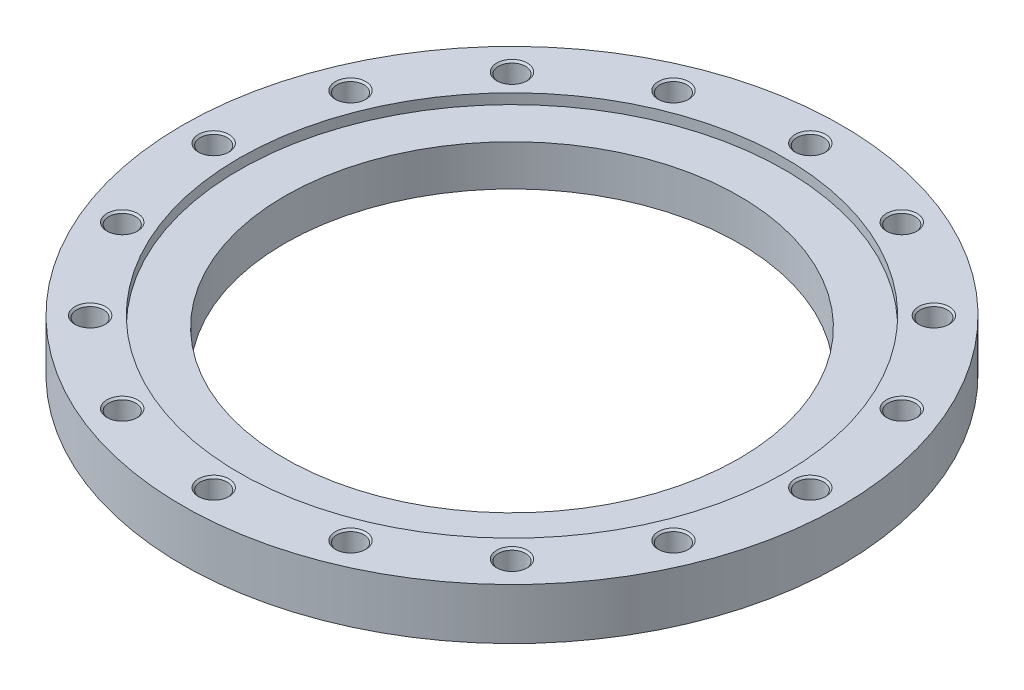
ISO-10303-21;
HEADER;
FILE_DESCRIPTION(('STEP AP214'),'2;1');
FILE_NAME('part.step','',(''),(''),'','','');
FILE_SCHEMA(('AUTOMOTIVE_DESIGN { 1 0 10303 214 1 1 1 1 }'));
ENDSEC;
DATA;
#1=APPLICATION_CONTEXT('core data for automotive mechanical design processes');
#2=APPLICATION_PROTOCOL_DEFINITION('international standard','automotive_design',2000,#1);
#3=PRODUCT_CONTEXT('',#1,'mechanical');
#4=PRODUCT('Part','Part','',(#3));
#5=PRODUCT_RELATED_PRODUCT_CATEGORY('part','',(#4));
#6=PRODUCT_DEFINITION_FORMATION('','',#4);
#7=PRODUCT_DEFINITION_CONTEXT('part definition',#1,'design');
#8=PRODUCT_DEFINITION('design','',#6,#7);
#9=PRODUCT_DEFINITION_SHAPE('','',#8);
#10=(LENGTH_UNIT() NAMED_UNIT(*) SI_UNIT(.MILLI.,.METRE.));
#11=(NAMED_UNIT(*) PLANE_ANGLE_UNIT() SI_UNIT($,.RADIAN.));
#12=(NAMED_UNIT(*) SI_UNIT($,.STERADIAN.) SOLID_ANGLE_UNIT());
#13=UNCERTAINTY_MEASURE_WITH_UNIT(LENGTH_MEASURE(1.E-05),#10,'distance_accuracy_value','');
#14=(GEOMETRIC_REPRESENTATION_CONTEXT(3) GLOBAL_UNCERTAINTY_ASSIGNED_CONTEXT((#13)) GLOBAL_UNIT_ASSIGNED_CONTEXT((#10,
#11,#12)) REPRESENTATION_CONTEXT('',''));
#15=CARTESIAN_POINT('',(0.,0.,0.));
#16=DIRECTION('',(0.,0.,1.));
#17=DIRECTION('',(1.,0.,0.));
#18=AXIS2_PLACEMENT_3D('',#15,#16,#17);
#19=CARTESIAN_POINT('',(0.,22.5,0.));
#20=DIRECTION('',(0.,-1.,0.));
#21=DIRECTION('',(1.,0.,0.));
#22=AXIS2_PLACEMENT_3D('',#19,#20,#21);
#23=CYLINDRICAL_SURFACE('',#22,290.);
#24=CARTESIAN_POINT('',(0.,0.,0.));
#25=DIRECTION('',(0.,1.,0.));
#26=DIRECTION('',(1.,0.,0.));
#27=AXIS2_PLACEMENT_3D('',#24,#25,#26);
#28=CIRCLE('',#27,290.);
#29=CARTESIAN_POINT('',(290.,0.,0.));
#30=VERTEX_POINT('',#29);
#31=EDGE_CURVE('E9',#30,#30,#28,.T.);
#32=ORIENTED_EDGE('',*,*,#31,.T.);
#33=EDGE_LOOP('',(#32));
#34=FACE_BOUND('',#33,.T.);
#35=CARTESIAN_POINT('',(0.,45.,0.));
#36=DIRECTION('',(0.,1.,0.));
#37=DIRECTION('',(1.,0.,0.));
#38=AXIS2_PLACEMENT_3D('',#35,#36,#37);
#39=CIRCLE('',#38,290.);
#40=CARTESIAN_POINT('',(290.,45.,0.));
#41=VERTEX_POINT('',#40);
#42=EDGE_CURVE('E460',#41,#41,#39,.T.);
#43=ORIENTED_EDGE('',*,*,#42,.F.);
#44=EDGE_LOOP('',(#43));
#45=FACE_BOUND('',#44,.T.);
#46=ADVANCED_FACE('F15',(#34,#45),#23,.T.);
#47=CARTESIAN_POINT('',(245.,0.,0.));
#48=DIRECTION('',(0.,-1.,0.));
#49=DIRECTION('',(-1.,0.,0.));
#50=AXIS2_PLACEMENT_3D('',#47,#48,#49);
#51=PLANE('',#50);
#52=CARTESIAN_POINT('',(0.,0.,0.));
#53=DIRECTION('',(0.,1.,0.));
#54=DIRECTION('',(1.,0.,0.));
#55=AXIS2_PLACEMENT_3D('',#52,#53,#54);
#56=CIRCLE('',#55,200.);
#57=CARTESIAN_POINT('',(200.,0.,0.));
#58=VERTEX_POINT('',#57);
#59=EDGE_CURVE('E24',#58,#58,#56,.T.);
#60=ORIENTED_EDGE('',*,*,#59,.T.);
#61=EDGE_LOOP('',(#60));
#62=FACE_BOUND('',#61,.T.);
#63=ORIENTED_EDGE('',*,*,#31,.F.);
#64=EDGE_LOOP('',(#63));
#65=FACE_BOUND('',#64,.T.);
#66=ADVANCED_FACE('F582',(#62,#65),#51,.T.);
#67=CARTESIAN_POINT('',(0.,22.5,0.));
#68=DIRECTION('',(0.,-1.,0.));
#69=DIRECTION('',(1.,0.,0.));
#70=AXIS2_PLACEMENT_3D('',#67,#68,#69);
#71=CYLINDRICAL_SURFACE('',#70,200.);
#72=ORIENTED_EDGE('',*,*,#59,.F.);
#73=EDGE_LOOP('',(#72));
#74=FACE_BOUND('',#73,.T.);
#75=CARTESIAN_POINT('',(0.,36.,0.));
#76=DIRECTION('',(0.,1.,0.));
#77=DIRECTION('',(1.,0.,0.));
#78=AXIS2_PLACEMENT_3D('',#75,#76,#77);
#79=CIRCLE('',#78,200.);
#80=CARTESIAN_POINT('',(-200.,36.,0.));
#81=VERTEX_POINT('',#80);
#82=EDGE_CURVE('E459',#81,#81,#79,.T.);
#83=ORIENTED_EDGE('',*,*,#82,.T.);
#84=EDGE_LOOP('',(#83));
#85=FACE_BOUND('',#84,.T.);
#86=ADVANCED_FACE('F587',(#74,#85),#71,.F.);
#87=CARTESIAN_POINT('',(245.,45.,0.));
#88=DIRECTION('',(0.,1.,0.));
#89=DIRECTION('',(1.,0.,0.));
#90=AXIS2_PLACEMENT_3D('',#87,#88,#89);
#91=PLANE('',#90);
#92=ORIENTED_EDGE('',*,*,#42,.T.);
#93=EDGE_LOOP('',(#92));
#94=FACE_BOUND('',#93,.T.);
#95=CARTESIAN_POINT('',(0.,45.,0.));
#96=DIRECTION('',(0.,-1.,0.));
#97=DIRECTION('',(1.,0.,0.));
#98=AXIS2_PLACEMENT_3D('',#95,#96,#97);
#99=CIRCLE('',#98,240.);
#100=CARTESIAN_POINT('',(-240.,45.,0.));
#101=VERTEX_POINT('',#100);
#102=EDGE_CURVE('E454',#101,#101,#99,.T.);
#103=ORIENTED_EDGE('',*,*,#102,.T.);
#104=EDGE_LOOP('',(#103));
#105=FACE_BOUND('',#104,.T.);
#106=CARTESIAN_POINT('',(262.5,45.,0.));
#107=DIRECTION('',(0.,-1.,0.));
#108=DIRECTION('',(1.,0.,0.));
#109=AXIS2_PLACEMENT_3D('',#106,#107,#108);
#110=CIRCLE('',#109,13.5);
#111=CARTESIAN_POINT('',(276.,45.,0.));
#112=VERTEX_POINT('',#111);
#113=EDGE_CURVE('E491',#112,#112,#110,.T.);
#114=ORIENTED_EDGE('',*,*,#113,.T.);
#115=EDGE_LOOP('',(#114));
#116=FACE_BOUND('',#115,.T.);
#117=CARTESIAN_POINT('',(242.518377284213,45.,-100.454400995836));
#118=DIRECTION('',(0.,-1.,0.));
#119=DIRECTION('',(0.923879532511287,0.,-0.38268343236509));
#120=AXIS2_PLACEMENT_3D('',#117,#118,#119);
#121=CIRCLE('',#120,13.5);
#122=CARTESIAN_POINT('',(254.990750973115,45.,-105.620627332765));
#123=VERTEX_POINT('',#122);
#124=EDGE_CURVE('E445',#123,#123,#121,.T.);
#125=ORIENTED_EDGE('',*,*,#124,.T.);
#126=EDGE_LOOP('',(#125));
#127=FACE_BOUND('',#126,.T.);
#128=CARTESIAN_POINT('',(185.615530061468,45.,-185.615530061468));
#129=DIRECTION('',(0.,-1.,0.));
#130=DIRECTION('',(0.707106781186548,0.,-0.707106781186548));
#131=AXIS2_PLACEMENT_3D('',#128,#129,#130);
#132=CIRCLE('',#131,13.5);
#133=CARTESIAN_POINT('',(195.161471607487,45.,-195.161471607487));
#134=VERTEX_POINT('',#133);
#135=EDGE_CURVE('E434',#134,#134,#132,.T.);
#136=ORIENTED_EDGE('',*,*,#135,.T.);
#137=EDGE_LOOP('',(#136));
#138=FACE_BOUND('',#137,.T.);
#139=CARTESIAN_POINT('',(100.454400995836,45.,-242.518377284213));
#140=DIRECTION('',(0.,-1.,0.));
#141=DIRECTION('',(0.38268343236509,0.,-0.923879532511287));
#142=AXIS2_PLACEMENT_3D('',#139,#140,#141);
#143=CIRCLE('',#142,13.5);
#144=CARTESIAN_POINT('',(105.620627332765,45.,-254.990750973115));
#145=VERTEX_POINT('',#144);
#146=EDGE_CURVE('E423',#145,#145,#143,.T.);
#147=ORIENTED_EDGE('',*,*,#146,.T.);
#148=EDGE_LOOP('',(#147));
#149=FACE_BOUND('',#148,.T.);
#150=CARTESIAN_POINT('',(0.,45.,-262.5));
#151=DIRECTION('',(0.,-1.,0.));
#152=DIRECTION('',(0.,0.,-1.));
#153=AXIS2_PLACEMENT_3D('',#150,#151,#152);
#154=CIRCLE('',#153,13.5);
#155=CARTESIAN_POINT('',(0.,45.,-276.));
#156=VERTEX_POINT('',#155);
#157=EDGE_CURVE('E413',#156,#156,#154,.T.);
#158=ORIENTED_EDGE('',*,*,#157,.T.);
#159=EDGE_LOOP('',(#158));
#160=FACE_BOUND('',#159,.T.);
#161=CARTESIAN_POINT('',(-100.454400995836,45.,-242.518377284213));
#162=DIRECTION('',(0.,-1.,0.));
#163=DIRECTION('',(-0.38268343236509,0.,-0.923879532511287));
#164=AXIS2_PLACEMENT_3D('',#161,#162,#163);
#165=CIRCLE('',#164,13.5);
#166=CARTESIAN_POINT('',(-105.620627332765,45.,-254.990750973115));
#167=VERTEX_POINT('',#166);
#168=EDGE_CURVE('E407',#167,#167,#165,.T.);
#169=ORIENTED_EDGE('',*,*,#168,.T.);
#170=EDGE_LOOP('',(#169));
#171=FACE_BOUND('',#170,.T.);
#172=CARTESIAN_POINT('',(-185.615530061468,45.,-185.615530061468));
#173=DIRECTION('',(0.,-1.,0.));
#174=DIRECTION('',(-0.707106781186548,0.,-0.707106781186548));
#175=AXIS2_PLACEMENT_3D('',#172,#173,#174);
#176=CIRCLE('',#175,13.5);
#177=CARTESIAN_POINT('',(-195.161471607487,45.,-195.161471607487));
#178=VERTEX_POINT('',#177);
#179=EDGE_CURVE('E396',#178,#178,#176,.T.);
#180=ORIENTED_EDGE('',*,*,#179,.T.);
#181=EDGE_LOOP('',(#180));
#182=FACE_BOUND('',#181,.T.);
#183=CARTESIAN_POINT('',(-242.518377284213,45.,-100.454400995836));
#184=DIRECTION('',(0.,-1.,0.));
#185=DIRECTION('',(-0.923879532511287,0.,-0.38268343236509));
#186=AXIS2_PLACEMENT_3D('',#183,#184,#185);
#187=CIRCLE('',#186,13.5);
#188=CARTESIAN_POINT('',(-254.990750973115,45.,-105.620627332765));
#189=VERTEX_POINT('',#188);
#190=EDGE_CURVE('E387',#189,#189,#187,.T.);
#191=ORIENTED_EDGE('',*,*,#190,.T.);
#192=EDGE_LOOP('',(#191));
#193=FACE_BOUND('',#192,.T.);
#194=CARTESIAN_POINT('',(-262.5,45.,0.));
#195=DIRECTION('',(0.,-1.,0.));
#196=DIRECTION('',(-1.,0.,0.));
#197=AXIS2_PLACEMENT_3D('',#194,#195,#196);
#198=CIRCLE('',#197,13.5);
#199=CARTESIAN_POINT('',(-276.,45.,0.));
#200=VERTEX_POINT('',#199);
#201=EDGE_CURVE('E552',#200,#200,#198,.T.);
#202=ORIENTED_EDGE('',*,*,#201,.T.);
#203=EDGE_LOOP('',(#202));
#204=FACE_BOUND('',#203,.T.);
#205=CARTESIAN_POINT('',(-242.518377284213,45.,100.454400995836));
#206=DIRECTION('',(0.,-1.,0.));
#207=DIRECTION('',(-0.923879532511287,0.,0.38268343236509));
#208=AXIS2_PLACEMENT_3D('',#205,#206,#207);
#209=CIRCLE('',#208,13.5);
#210=CARTESIAN_POINT('',(-254.990750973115,45.,105.620627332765));
#211=VERTEX_POINT('',#210);
#212=EDGE_CURVE('E534',#211,#211,#209,.T.);
#213=ORIENTED_EDGE('',*,*,#212,.T.);
#214=EDGE_LOOP('',(#213));
#215=FACE_BOUND('',#214,.T.);
#216=CARTESIAN_POINT('',(-185.615530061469,45.,185.615530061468));
#217=DIRECTION('',(0.,-1.,0.));
#218=DIRECTION('',(-0.707106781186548,0.,0.707106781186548));
#219=AXIS2_PLACEMENT_3D('',#216,#217,#218);
#220=CIRCLE('',#219,13.5);
#221=CARTESIAN_POINT('',(-195.161471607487,45.,195.161471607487));
#222=VERTEX_POINT('',#221);
#223=EDGE_CURVE('E517',#222,#222,#220,.T.);
#224=ORIENTED_EDGE('',*,*,#223,.T.);
#225=EDGE_LOOP('',(#224));
#226=FACE_BOUND('',#225,.T.);
#227=CARTESIAN_POINT('',(-100.454400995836,45.,242.518377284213));
#228=DIRECTION('',(0.,-1.,0.));
#229=DIRECTION('',(-0.382683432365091,0.,0.923879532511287));
#230=AXIS2_PLACEMENT_3D('',#227,#228,#229);
#231=CIRCLE('',#230,13.5);
#232=CARTESIAN_POINT('',(-105.620627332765,45.,254.990750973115));
#233=VERTEX_POINT('',#232);
#234=EDGE_CURVE('E505',#233,#233,#231,.T.);
#235=ORIENTED_EDGE('',*,*,#234,.T.);
#236=EDGE_LOOP('',(#235));
#237=FACE_BOUND('',#236,.T.);
#238=CARTESIAN_POINT('',(0.,45.,262.5));
#239=DIRECTION('',(0.,-1.,0.));
#240=DIRECTION('',(0.,0.,1.));
#241=AXIS2_PLACEMENT_3D('',#238,#239,#240);
#242=CIRCLE('',#241,13.5);
#243=CARTESIAN_POINT('',(0.,45.,276.));
#244=VERTEX_POINT('',#243);
#245=EDGE_CURVE('E489',#244,#244,#242,.T.);
#246=ORIENTED_EDGE('',*,*,#245,.T.);
#247=EDGE_LOOP('',(#246));
#248=FACE_BOUND('',#247,.T.);
#249=CARTESIAN_POINT('',(100.454400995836,45.,242.518377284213));
#250=DIRECTION('',(0.,-1.,0.));
#251=DIRECTION('',(0.38268343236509,0.,0.923879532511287));
#252=AXIS2_PLACEMENT_3D('',#249,#250,#251);
#253=CIRCLE('',#252,13.5);
#254=CARTESIAN_POINT('',(105.620627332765,45.,254.990750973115));
#255=VERTEX_POINT('',#254);
#256=EDGE_CURVE('E481',#255,#255,#253,.T.);
#257=ORIENTED_EDGE('',*,*,#256,.T.);
#258=EDGE_LOOP('',(#257));
#259=FACE_BOUND('',#258,.T.);
#260=CARTESIAN_POINT('',(185.615530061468,45.,185.615530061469));
#261=DIRECTION('',(0.,-1.,0.));
#262=DIRECTION('',(0.707106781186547,0.,0.707106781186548));
#263=AXIS2_PLACEMENT_3D('',#260,#261,#262);
#264=CIRCLE('',#263,13.5);
#265=CARTESIAN_POINT('',(195.161471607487,45.,195.161471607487));
#266=VERTEX_POINT('',#265);
#267=EDGE_CURVE('E1622',#266,#266,#264,.T.);
#268=ORIENTED_EDGE('',*,*,#267,.T.);
#269=EDGE_LOOP('',(#268));
#270=FACE_BOUND('',#269,.T.);
#271=CARTESIAN_POINT('',(242.518377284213,45.,100.454400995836));
#272=DIRECTION('',(0.,-1.,0.));
#273=DIRECTION('',(0.923879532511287,0.,0.382683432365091));
#274=AXIS2_PLACEMENT_3D('',#271,#272,#273);
#275=CIRCLE('',#274,13.5);
#276=CARTESIAN_POINT('',(254.990750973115,45.,105.620627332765));
#277=VERTEX_POINT('',#276);
#278=EDGE_CURVE('E1624',#277,#277,#275,.T.);
#279=ORIENTED_EDGE('',*,*,#278,.T.);
#280=EDGE_LOOP('',(#279));
#281=FACE_BOUND('',#280,.T.);
#282=ADVANCED_FACE('F17',(#94,#105,#116,#127,#138,#149,#160,#171,#182,#193,#204,#215,#226,#237,
#248,#259,#270,#281),#91,.T.);
#283=CARTESIAN_POINT('',(0.,36.,0.));
#284=DIRECTION('',(0.,-1.,0.));
#285=DIRECTION('',(-1.,0.,0.));
#286=AXIS2_PLACEMENT_3D('',#283,#284,#285);
#287=PLANE('',#286);
#288=CARTESIAN_POINT('',(0.,36.,0.));
#289=DIRECTION('',(0.,-1.,0.));
#290=DIRECTION('',(1.,0.,0.));
#291=AXIS2_PLACEMENT_3D('',#288,#289,#290);
#292=CIRCLE('',#291,240.);
#293=CARTESIAN_POINT('',(240.,36.,0.));
#294=VERTEX_POINT('',#293);
#295=EDGE_CURVE('E457',#294,#294,#292,.T.);
#296=ORIENTED_EDGE('',*,*,#295,.F.);
#297=EDGE_LOOP('',(#296));
#298=FACE_BOUND('',#297,.T.);
#299=ORIENTED_EDGE('',*,*,#82,.F.);
#300=EDGE_LOOP('',(#299));
#301=FACE_BOUND('',#300,.T.);
#302=ADVANCED_FACE('F1523',(#298,#301),#287,.F.);
#303=CARTESIAN_POINT('',(0.,42.75,0.));
#304=DIRECTION('',(0.,-1.,0.));
#305=DIRECTION('',(1.,0.,0.));
#306=AXIS2_PLACEMENT_3D('',#303,#304,#305);
#307=CYLINDRICAL_SURFACE('',#306,240.);
#308=ORIENTED_EDGE('',*,*,#295,.T.);
#309=EDGE_LOOP('',(#308));
#310=FACE_BOUND('',#309,.T.);
#311=ORIENTED_EDGE('',*,*,#102,.F.);
#312=EDGE_LOOP('',(#311));
#313=FACE_BOUND('',#312,.T.);
#314=ADVANCED_FACE('F1514',(#310,#313),#307,.F.);
#315=CARTESIAN_POINT('',(262.5,5.57162193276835,0.));
#316=DIRECTION('',(0.,1.,0.));
#317=DIRECTION('',(1.,0.,0.));
#318=AXIS2_PLACEMENT_3D('',#315,#316,#317);
#319=CONICAL_SURFACE('',#318,5.938125,1.0471975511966);
#320=CARTESIAN_POINT('',(262.5,9.,0.));
#321=DIRECTION('',(0.,-1.,0.));
#322=DIRECTION('',(1.,0.,0.));
#323=AXIS2_PLACEMENT_3D('',#320,#321,#322);
#324=CIRCLE('',#323,11.87625);
#325=CARTESIAN_POINT('',(274.37625,9.,0.));
#326=VERTEX_POINT('',#325);
#327=EDGE_CURVE('E458',#326,#326,#324,.T.);
#328=ORIENTED_EDGE('',*,*,#327,.F.);
#329=EDGE_LOOP('',(#328));
#330=FACE_BOUND('',#329,.T.);
#331=CARTESIAN_POINT('',(262.5,2.1432438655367,0.));
#332=VERTEX_POINT('',#331);
#333=VERTEX_LOOP('',#332);
#334=FACE_BOUND('',#333,.T.);
#335=ADVANCED_FACE('F1505',(#330,#334),#319,.F.);
#336=CARTESIAN_POINT('',(262.5,13.688125,0.));
#337=DIRECTION('',(0.,1.,0.));
#338=DIRECTION('',(1.,0.,0.));
#339=AXIS2_PLACEMENT_3D('',#336,#337,#338);
#340=CYLINDRICAL_SURFACE('',#339,11.87625);
#341=CARTESIAN_POINT('',(262.5,18.37625,0.));
#342=DIRECTION('',(0.,-1.,0.));
#343=DIRECTION('',(1.,0.,0.));
#344=AXIS2_PLACEMENT_3D('',#341,#342,#343);
#345=CIRCLE('',#344,11.87625);
#346=CARTESIAN_POINT('',(274.37625,18.37625,0.));
#347=VERTEX_POINT('',#346);
#348=EDGE_CURVE('E452',#347,#347,#345,.T.);
#349=ORIENTED_EDGE('',*,*,#348,.F.);
#350=EDGE_LOOP('',(#349));
#351=FACE_BOUND('',#350,.T.);
#352=ORIENTED_EDGE('',*,*,#327,.T.);
#353=EDGE_LOOP('',(#352));
#354=FACE_BOUND('',#353,.T.);
#355=ADVANCED_FACE('F1496',(#351,#354),#340,.F.);
#356=CARTESIAN_POINT('',(262.5,19.188125,0.));
#357=DIRECTION('',(0.,1.,0.));
#358=DIRECTION('',(1.,0.,0.));
#359=AXIS2_PLACEMENT_3D('',#356,#357,#358);
#360=CONICAL_SURFACE('',#359,12.688125,0.785398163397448);
#361=CARTESIAN_POINT('',(262.5,20.,0.));
#362=DIRECTION('',(0.,-1.,0.));
#363=DIRECTION('',(1.,0.,0.));
#364=AXIS2_PLACEMENT_3D('',#361,#362,#363);
#365=CIRCLE('',#364,13.5);
#366=CARTESIAN_POINT('',(276.,20.,0.));
#367=VERTEX_POINT('',#366);
#368=EDGE_CURVE('E450',#367,#367,#365,.T.);
#369=ORIENTED_EDGE('',*,*,#368,.F.);
#370=EDGE_LOOP('',(#369));
#371=FACE_BOUND('',#370,.T.);
#372=ORIENTED_EDGE('',*,*,#348,.T.);
#373=EDGE_LOOP('',(#372));
#374=FACE_BOUND('',#373,.T.);
#375=ADVANCED_FACE('F777',(#371,#374),#360,.F.);
#376=CARTESIAN_POINT('',(275.188125,20.,0.));
#377=DIRECTION('',(0.,1.,0.));
#378=DIRECTION('',(-1.,0.,0.));
#379=AXIS2_PLACEMENT_3D('',#376,#377,#378);
#380=PLANE('',#379);
#381=CARTESIAN_POINT('',(262.5,20.,0.));
#382=DIRECTION('',(0.,-1.,0.));
#383=DIRECTION('',(1.,0.,0.));
#384=AXIS2_PLACEMENT_3D('',#381,#382,#383);
#385=CIRCLE('',#384,11.87625);
#386=CARTESIAN_POINT('',(274.37625,20.,0.));
#387=VERTEX_POINT('',#386);
#388=EDGE_CURVE('E453',#387,#387,#385,.T.);
#389=ORIENTED_EDGE('',*,*,#388,.F.);
#390=EDGE_LOOP('',(#389));
#391=FACE_BOUND('',#390,.T.);
#392=ORIENTED_EDGE('',*,*,#368,.T.);
#393=EDGE_LOOP('',(#392));
#394=FACE_BOUND('',#393,.T.);
#395=ADVANCED_FACE('F773',(#391,#394),#380,.F.);
#396=CARTESIAN_POINT('',(262.5,31.688125,0.));
#397=DIRECTION('',(0.,1.,0.));
#398=DIRECTION('',(1.,0.,0.));
#399=AXIS2_PLACEMENT_3D('',#396,#397,#398);
#400=CYLINDRICAL_SURFACE('',#399,11.87625);
#401=CARTESIAN_POINT('',(262.5,43.37625,0.));
#402=DIRECTION('',(0.,-1.,0.));
#403=DIRECTION('',(1.,0.,0.));
#404=AXIS2_PLACEMENT_3D('',#401,#402,#403);
#405=CIRCLE('',#404,11.87625);
#406=CARTESIAN_POINT('',(274.37625,43.37625,0.));
#407=VERTEX_POINT('',#406);
#408=EDGE_CURVE('E448',#407,#407,#405,.T.);
#409=ORIENTED_EDGE('',*,*,#408,.F.);
#410=EDGE_LOOP('',(#409));
#411=FACE_BOUND('',#410,.T.);
#412=ORIENTED_EDGE('',*,*,#388,.T.);
#413=EDGE_LOOP('',(#412));
#414=FACE_BOUND('',#413,.T.);
#415=ADVANCED_FACE('F776',(#411,#414),#400,.F.);
#416=CARTESIAN_POINT('',(262.5,44.188125,0.));
#417=DIRECTION('',(0.,1.,0.));
#418=DIRECTION('',(1.,0.,0.));
#419=AXIS2_PLACEMENT_3D('',#416,#417,#418);
#420=CONICAL_SURFACE('',#419,12.688125,0.785398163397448);
#421=ORIENTED_EDGE('',*,*,#113,.F.);
#422=EDGE_LOOP('',(#421));
#423=FACE_BOUND('',#422,.T.);
#424=ORIENTED_EDGE('',*,*,#408,.T.);
#425=EDGE_LOOP('',(#424));
#426=FACE_BOUND('',#425,.T.);
#427=ADVANCED_FACE('F799',(#423,#426),#420,.F.);
#428=CARTESIAN_POINT('',(242.518377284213,5.57162193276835,-100.454400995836));
#429=DIRECTION('',(0.,1.,0.));
#430=DIRECTION('',(0.923879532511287,0.,-0.38268343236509));
#431=AXIS2_PLACEMENT_3D('',#428,#429,#430);
#432=CONICAL_SURFACE('',#431,5.938125,1.0471975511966);
#433=CARTESIAN_POINT('',(242.518377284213,9.,-100.454400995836));
#434=DIRECTION('',(0.,-1.,0.));
#435=DIRECTION('',(0.923879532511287,0.,-0.38268343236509));
#436=AXIS2_PLACEMENT_3D('',#433,#434,#435);
#437=CIRCLE('',#436,11.87625);
#438=CARTESIAN_POINT('',(253.4906015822,9.,-104.999245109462));
#439=VERTEX_POINT('',#438);
#440=EDGE_CURVE('E446',#439,#439,#437,.T.);
#441=ORIENTED_EDGE('',*,*,#440,.F.);
#442=EDGE_LOOP('',(#441));
#443=FACE_BOUND('',#442,.T.);
#444=CARTESIAN_POINT('',(242.518377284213,2.1432438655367,-100.454400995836));
#445=VERTEX_POINT('',#444);
#446=VERTEX_LOOP('',#445);
#447=FACE_BOUND('',#446,.T.);
#448=ADVANCED_FACE('F663',(#443,#447),#432,.F.);
#449=CARTESIAN_POINT('',(242.518377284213,13.688125,-100.454400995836));
#450=DIRECTION('',(0.,1.,0.));
#451=DIRECTION('',(0.923879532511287,0.,-0.38268343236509));
#452=AXIS2_PLACEMENT_3D('',#449,#450,#451);
#453=CYLINDRICAL_SURFACE('',#452,11.87625);
#454=CARTESIAN_POINT('',(242.518377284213,18.37625,-100.454400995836));
#455=DIRECTION('',(0.,-1.,0.));
#456=DIRECTION('',(0.923879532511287,0.,-0.38268343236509));
#457=AXIS2_PLACEMENT_3D('',#454,#455,#456);
#458=CIRCLE('',#457,11.87625);
#459=CARTESIAN_POINT('',(253.4906015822,18.37625,-104.999245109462));
#460=VERTEX_POINT('',#459);
#461=EDGE_CURVE('E449',#460,#460,#458,.T.);
#462=ORIENTED_EDGE('',*,*,#461,.F.);
#463=EDGE_LOOP('',(#462));
#464=FACE_BOUND('',#463,.T.);
#465=ORIENTED_EDGE('',*,*,#440,.T.);
#466=EDGE_LOOP('',(#465));
#467=FACE_BOUND('',#466,.T.);
#468=ADVANCED_FACE('F659',(#464,#467),#453,.F.);
#469=CARTESIAN_POINT('',(242.518377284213,19.188125,-100.454400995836));
#470=DIRECTION('',(0.,1.,0.));
#471=DIRECTION('',(0.923879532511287,0.,-0.38268343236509));
#472=AXIS2_PLACEMENT_3D('',#469,#470,#471);
#473=CONICAL_SURFACE('',#472,12.688125,0.785398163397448);
#474=CARTESIAN_POINT('',(242.518377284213,20.,-100.454400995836));
#475=DIRECTION('',(0.,-1.,0.));
#476=DIRECTION('',(0.923879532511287,0.,-0.38268343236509));
#477=AXIS2_PLACEMENT_3D('',#474,#475,#476);
#478=CIRCLE('',#477,13.5);
#479=CARTESIAN_POINT('',(254.990750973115,20.,-105.620627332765));
#480=VERTEX_POINT('',#479);
#481=EDGE_CURVE('E521',#480,#480,#478,.T.);
#482=ORIENTED_EDGE('',*,*,#481,.F.);
#483=EDGE_LOOP('',(#482));
#484=FACE_BOUND('',#483,.T.);
#485=ORIENTED_EDGE('',*,*,#461,.T.);
#486=EDGE_LOOP('',(#485));
#487=FACE_BOUND('',#486,.T.);
#488=ADVANCED_FACE('F662',(#484,#487),#473,.F.);
#489=CARTESIAN_POINT('',(254.240676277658,20.,-105.309936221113));
#490=DIRECTION('',(0.,1.,0.));
#491=DIRECTION('',(-0.923879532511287,0.,0.38268343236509));
#492=AXIS2_PLACEMENT_3D('',#489,#490,#491);
#493=PLANE('',#492);
#494=CARTESIAN_POINT('',(242.518377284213,20.,-100.454400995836));
#495=DIRECTION('',(0.,-1.,0.));
#496=DIRECTION('',(0.923879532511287,0.,-0.38268343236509));
#497=AXIS2_PLACEMENT_3D('',#494,#495,#496);
#498=CIRCLE('',#497,11.87625);
#499=CARTESIAN_POINT('',(253.4906015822,20.,-104.999245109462));
#500=VERTEX_POINT('',#499);
#501=EDGE_CURVE('E522',#500,#500,#498,.T.);
#502=ORIENTED_EDGE('',*,*,#501,.F.);
#503=EDGE_LOOP('',(#502));
#504=FACE_BOUND('',#503,.T.);
#505=ORIENTED_EDGE('',*,*,#481,.T.);
#506=EDGE_LOOP('',(#505));
#507=FACE_BOUND('',#506,.T.);
#508=ADVANCED_FACE('F673',(#504,#507),#493,.F.);
#509=CARTESIAN_POINT('',(242.518377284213,31.688125,-100.454400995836));
#510=DIRECTION('',(0.,1.,0.));
#511=DIRECTION('',(0.923879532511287,0.,-0.38268343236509));
#512=AXIS2_PLACEMENT_3D('',#509,#510,#511);
#513=CYLINDRICAL_SURFACE('',#512,11.87625);
#514=CARTESIAN_POINT('',(242.518377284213,43.37625,-100.454400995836));
#515=DIRECTION('',(0.,-1.,0.));
#516=DIRECTION('',(0.923879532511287,0.,-0.38268343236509));
#517=AXIS2_PLACEMENT_3D('',#514,#515,#516);
#518=CIRCLE('',#517,11.87625);
#519=CARTESIAN_POINT('',(253.4906015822,43.37625,-104.999245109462));
#520=VERTEX_POINT('',#519);
#521=EDGE_CURVE('E443',#520,#520,#518,.T.);
#522=ORIENTED_EDGE('',*,*,#521,.F.);
#523=EDGE_LOOP('',(#522));
#524=FACE_BOUND('',#523,.T.);
#525=ORIENTED_EDGE('',*,*,#501,.T.);
#526=EDGE_LOOP('',(#525));
#527=FACE_BOUND('',#526,.T.);
#528=ADVANCED_FACE('F669',(#524,#527),#513,.F.);
#529=CARTESIAN_POINT('',(242.518377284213,44.188125,-100.454400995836));
#530=DIRECTION('',(0.,1.,0.));
#531=DIRECTION('',(0.923879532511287,0.,-0.38268343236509));
#532=AXIS2_PLACEMENT_3D('',#529,#530,#531);
#533=CONICAL_SURFACE('',#532,12.688125,0.785398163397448);
#534=ORIENTED_EDGE('',*,*,#124,.F.);
#535=EDGE_LOOP('',(#534));
#536=FACE_BOUND('',#535,.T.);
#537=ORIENTED_EDGE('',*,*,#521,.T.);
#538=EDGE_LOOP('',(#537));
#539=FACE_BOUND('',#538,.T.);
#540=ADVANCED_FACE('F672',(#536,#539),#533,.F.);
#541=CARTESIAN_POINT('',(185.615530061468,5.57162193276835,-185.615530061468));
#542=DIRECTION('',(0.,1.,0.));
#543=DIRECTION('',(0.707106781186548,0.,-0.707106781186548));
#544=AXIS2_PLACEMENT_3D('',#541,#542,#543);
#545=CONICAL_SURFACE('',#544,5.938125,1.0471975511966);
#546=CARTESIAN_POINT('',(185.615530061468,9.,-185.615530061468));
#547=DIRECTION('',(0.,-1.,0.));
#548=DIRECTION('',(0.707106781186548,0.,-0.707106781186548));
#549=AXIS2_PLACEMENT_3D('',#546,#547,#548);
#550=CIRCLE('',#549,11.87625);
#551=CARTESIAN_POINT('',(194.013306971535,9.,-194.013306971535));
#552=VERTEX_POINT('',#551);
#553=EDGE_CURVE('E441',#552,#552,#550,.T.);
#554=ORIENTED_EDGE('',*,*,#553,.F.);
#555=EDGE_LOOP('',(#554));
#556=FACE_BOUND('',#555,.T.);
#557=CARTESIAN_POINT('',(185.615530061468,2.1432438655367,-185.615530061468));
#558=VERTEX_POINT('',#557);
#559=VERTEX_LOOP('',#558);
#560=FACE_BOUND('',#559,.T.);
#561=ADVANCED_FACE('F731',(#556,#560),#545,.F.);
#562=CARTESIAN_POINT('',(185.615530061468,13.688125,-185.615530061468));
#563=DIRECTION('',(0.,1.,0.));
#564=DIRECTION('',(0.707106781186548,0.,-0.707106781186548));
#565=AXIS2_PLACEMENT_3D('',#562,#563,#564);
#566=CYLINDRICAL_SURFACE('',#565,11.87625);
#567=CARTESIAN_POINT('',(185.615530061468,18.37625,-185.615530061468));
#568=DIRECTION('',(0.,-1.,0.));
#569=DIRECTION('',(0.707106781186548,0.,-0.707106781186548));
#570=AXIS2_PLACEMENT_3D('',#567,#568,#569);
#571=CIRCLE('',#570,11.87625);
#572=CARTESIAN_POINT('',(194.013306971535,18.37625,-194.013306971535));
#573=VERTEX_POINT('',#572);
#574=EDGE_CURVE('E439',#573,#573,#571,.T.);
#575=ORIENTED_EDGE('',*,*,#574,.F.);
#576=EDGE_LOOP('',(#575));
#577=FACE_BOUND('',#576,.T.);
#578=ORIENTED_EDGE('',*,*,#553,.T.);
#579=EDGE_LOOP('',(#578));
#580=FACE_BOUND('',#579,.T.);
#581=ADVANCED_FACE('F1417',(#577,#580),#566,.F.);
#582=CARTESIAN_POINT('',(185.615530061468,19.188125,-185.615530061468));
#583=DIRECTION('',(0.,1.,0.));
#584=DIRECTION('',(0.707106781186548,0.,-0.707106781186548));
#585=AXIS2_PLACEMENT_3D('',#582,#583,#584);
#586=CONICAL_SURFACE('',#585,12.688125,0.785398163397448);
#587=CARTESIAN_POINT('',(185.615530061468,20.,-185.615530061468));
#588=DIRECTION('',(0.,-1.,0.));
#589=DIRECTION('',(0.707106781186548,0.,-0.707106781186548));
#590=AXIS2_PLACEMENT_3D('',#587,#588,#589);
#591=CIRCLE('',#590,13.5);
#592=CARTESIAN_POINT('',(195.161471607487,20.,-195.161471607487));
#593=VERTEX_POINT('',#592);
#594=EDGE_CURVE('E438',#593,#593,#591,.T.);
#595=ORIENTED_EDGE('',*,*,#594,.F.);
#596=EDGE_LOOP('',(#595));
#597=FACE_BOUND('',#596,.T.);
#598=ORIENTED_EDGE('',*,*,#574,.T.);
#599=EDGE_LOOP('',(#598));
#600=FACE_BOUND('',#599,.T.);
#601=ADVANCED_FACE('F619',(#597,#600),#586,.F.);
#602=CARTESIAN_POINT('',(194.587389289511,20.,-194.587389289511));
#603=DIRECTION('',(0.,1.,0.));
#604=DIRECTION('',(-0.707106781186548,0.,0.707106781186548));
#605=AXIS2_PLACEMENT_3D('',#602,#603,#604);
#606=PLANE('',#605);
#607=CARTESIAN_POINT('',(185.615530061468,20.,-185.615530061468));
#608=DIRECTION('',(0.,-1.,0.));
#609=DIRECTION('',(0.707106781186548,0.,-0.707106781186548));
#610=AXIS2_PLACEMENT_3D('',#607,#608,#609);
#611=CIRCLE('',#610,11.87625);
#612=CARTESIAN_POINT('',(194.013306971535,20.,-194.013306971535));
#613=VERTEX_POINT('',#612);
#614=EDGE_CURVE('E436',#613,#613,#611,.T.);
#615=ORIENTED_EDGE('',*,*,#614,.F.);
#616=EDGE_LOOP('',(#615));
#617=FACE_BOUND('',#616,.T.);
#618=ORIENTED_EDGE('',*,*,#594,.T.);
#619=EDGE_LOOP('',(#618));
#620=FACE_BOUND('',#619,.T.);
#621=ADVANCED_FACE('F615',(#617,#620),#606,.F.);
#622=CARTESIAN_POINT('',(185.615530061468,31.688125,-185.615530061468));
#623=DIRECTION('',(0.,1.,0.));
#624=DIRECTION('',(0.707106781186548,0.,-0.707106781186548));
#625=AXIS2_PLACEMENT_3D('',#622,#623,#624);
#626=CYLINDRICAL_SURFACE('',#625,11.87625);
#627=CARTESIAN_POINT('',(185.615530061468,43.37625,-185.615530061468));
#628=DIRECTION('',(0.,-1.,0.));
#629=DIRECTION('',(0.707106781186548,0.,-0.707106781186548));
#630=AXIS2_PLACEMENT_3D('',#627,#628,#629);
#631=CIRCLE('',#630,11.87625);
#632=CARTESIAN_POINT('',(194.013306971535,43.37625,-194.013306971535));
#633=VERTEX_POINT('',#632);
#634=EDGE_CURVE('E432',#633,#633,#631,.T.);
#635=ORIENTED_EDGE('',*,*,#634,.F.);
#636=EDGE_LOOP('',(#635));
#637=FACE_BOUND('',#636,.T.);
#638=ORIENTED_EDGE('',*,*,#614,.T.);
#639=EDGE_LOOP('',(#638));
#640=FACE_BOUND('',#639,.T.);
#641=ADVANCED_FACE('F618',(#637,#640),#626,.F.);
#642=CARTESIAN_POINT('',(185.615530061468,44.188125,-185.615530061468));
#643=DIRECTION('',(0.,1.,0.));
#644=DIRECTION('',(0.707106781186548,0.,-0.707106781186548));
#645=AXIS2_PLACEMENT_3D('',#642,#643,#644);
#646=CONICAL_SURFACE('',#645,12.688125,0.785398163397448);
#647=ORIENTED_EDGE('',*,*,#135,.F.);
#648=EDGE_LOOP('',(#647));
#649=FACE_BOUND('',#648,.T.);
#650=ORIENTED_EDGE('',*,*,#634,.T.);
#651=EDGE_LOOP('',(#650));
#652=FACE_BOUND('',#651,.T.);
#653=ADVANCED_FACE('F646',(#649,#652),#646,.F.);
#654=CARTESIAN_POINT('',(100.454400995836,5.57162193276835,-242.518377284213));
#655=DIRECTION('',(0.,1.,0.));
#656=DIRECTION('',(0.38268343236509,0.,-0.923879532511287));
#657=AXIS2_PLACEMENT_3D('',#654,#655,#656);
#658=CONICAL_SURFACE('',#657,5.938125,1.0471975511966);
#659=CARTESIAN_POINT('',(100.454400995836,9.,-242.518377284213));
#660=DIRECTION('',(0.,-1.,0.));
#661=DIRECTION('',(0.38268343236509,0.,-0.923879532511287));
#662=AXIS2_PLACEMENT_3D('',#659,#660,#661);
#663=CIRCLE('',#662,11.87625);
#664=CARTESIAN_POINT('',(104.999245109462,9.,-253.4906015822));
#665=VERTEX_POINT('',#664);
#666=EDGE_CURVE('E430',#665,#665,#663,.T.);
#667=ORIENTED_EDGE('',*,*,#666,.F.);
#668=EDGE_LOOP('',(#667));
#669=FACE_BOUND('',#668,.T.);
#670=CARTESIAN_POINT('',(100.454400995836,2.1432438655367,-242.518377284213));
#671=VERTEX_POINT('',#670);
#672=VERTEX_LOOP('',#671);
#673=FACE_BOUND('',#672,.T.);
#674=ADVANCED_FACE('F1382',(#669,#673),#658,.F.);
#675=CARTESIAN_POINT('',(100.454400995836,13.688125,-242.518377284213));
#676=DIRECTION('',(0.,1.,0.));
#677=DIRECTION('',(0.38268343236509,0.,-0.923879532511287));
#678=AXIS2_PLACEMENT_3D('',#675,#676,#677);
#679=CYLINDRICAL_SURFACE('',#678,11.87625);
#680=CARTESIAN_POINT('',(100.454400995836,18.37625,-242.518377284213));
#681=DIRECTION('',(0.,-1.,0.));
#682=DIRECTION('',(0.38268343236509,0.,-0.923879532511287));
#683=AXIS2_PLACEMENT_3D('',#680,#681,#682);
#684=CIRCLE('',#683,11.87625);
#685=CARTESIAN_POINT('',(104.999245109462,18.37625,-253.4906015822));
#686=VERTEX_POINT('',#685);
#687=EDGE_CURVE('E429',#686,#686,#684,.T.);
#688=ORIENTED_EDGE('',*,*,#687,.F.);
#689=EDGE_LOOP('',(#688));
#690=FACE_BOUND('',#689,.T.);
#691=ORIENTED_EDGE('',*,*,#666,.T.);
#692=EDGE_LOOP('',(#691));
#693=FACE_BOUND('',#692,.T.);
#694=ADVANCED_FACE('F1373',(#690,#693),#679,.F.);
#695=CARTESIAN_POINT('',(100.454400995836,19.188125,-242.518377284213));
#696=DIRECTION('',(0.,1.,0.));
#697=DIRECTION('',(0.38268343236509,0.,-0.923879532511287));
#698=AXIS2_PLACEMENT_3D('',#695,#696,#697);
#699=CONICAL_SURFACE('',#698,12.688125,0.785398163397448);
#700=CARTESIAN_POINT('',(100.454400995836,20.,-242.518377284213));
#701=DIRECTION('',(0.,-1.,0.));
#702=DIRECTION('',(0.38268343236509,0.,-0.923879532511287));
#703=AXIS2_PLACEMENT_3D('',#700,#701,#702);
#704=CIRCLE('',#703,13.5);
#705=CARTESIAN_POINT('',(105.620627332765,20.,-254.990750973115));
#706=VERTEX_POINT('',#705);
#707=EDGE_CURVE('E427',#706,#706,#704,.T.);
#708=ORIENTED_EDGE('',*,*,#707,.F.);
#709=EDGE_LOOP('',(#708));
#710=FACE_BOUND('',#709,.T.);
#711=ORIENTED_EDGE('',*,*,#687,.T.);
#712=EDGE_LOOP('',(#711));
#713=FACE_BOUND('',#712,.T.);
#714=ADVANCED_FACE('F1364',(#710,#713),#699,.F.);
#715=CARTESIAN_POINT('',(105.309936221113,20.,-254.240676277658));
#716=DIRECTION('',(0.,1.,0.));
#717=DIRECTION('',(-0.38268343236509,0.,0.923879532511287));
#718=AXIS2_PLACEMENT_3D('',#715,#716,#717);
#719=PLANE('',#718);
#720=CARTESIAN_POINT('',(100.454400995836,20.,-242.518377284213));
#721=DIRECTION('',(0.,-1.,0.));
#722=DIRECTION('',(0.38268343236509,0.,-0.923879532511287));
#723=AXIS2_PLACEMENT_3D('',#720,#721,#722);
#724=CIRCLE('',#723,11.87625);
#725=CARTESIAN_POINT('',(104.999245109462,20.,-253.4906015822));
#726=VERTEX_POINT('',#725);
#727=EDGE_CURVE('E425',#726,#726,#724,.T.);
#728=ORIENTED_EDGE('',*,*,#727,.F.);
#729=EDGE_LOOP('',(#728));
#730=FACE_BOUND('',#729,.T.);
#731=ORIENTED_EDGE('',*,*,#707,.T.);
#732=EDGE_LOOP('',(#731));
#733=FACE_BOUND('',#732,.T.);
#734=ADVANCED_FACE('F609',(#730,#733),#719,.F.);
#735=CARTESIAN_POINT('',(100.454400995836,31.688125,-242.518377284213));
#736=DIRECTION('',(0.,1.,0.));
#737=DIRECTION('',(0.38268343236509,0.,-0.923879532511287));
#738=AXIS2_PLACEMENT_3D('',#735,#736,#737);
#739=CYLINDRICAL_SURFACE('',#738,11.87625);
#740=CARTESIAN_POINT('',(100.454400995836,43.37625,-242.518377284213));
#741=DIRECTION('',(0.,-1.,0.));
#742=DIRECTION('',(0.38268343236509,0.,-0.923879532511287));
#743=AXIS2_PLACEMENT_3D('',#740,#741,#742);
#744=CIRCLE('',#743,11.87625);
#745=CARTESIAN_POINT('',(104.999245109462,43.37625,-253.4906015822));
#746=VERTEX_POINT('',#745);
#747=EDGE_CURVE('E421',#746,#746,#744,.T.);
#748=ORIENTED_EDGE('',*,*,#747,.F.);
#749=EDGE_LOOP('',(#748));
#750=FACE_BOUND('',#749,.T.);
#751=ORIENTED_EDGE('',*,*,#727,.T.);
#752=EDGE_LOOP('',(#751));
#753=FACE_BOUND('',#752,.T.);
#754=ADVANCED_FACE('F605',(#750,#753),#739,.F.);
#755=CARTESIAN_POINT('',(100.454400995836,44.188125,-242.518377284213));
#756=DIRECTION('',(0.,1.,0.));
#757=DIRECTION('',(0.38268343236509,0.,-0.923879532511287));
#758=AXIS2_PLACEMENT_3D('',#755,#756,#757);
#759=CONICAL_SURFACE('',#758,12.688125,0.785398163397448);
#760=ORIENTED_EDGE('',*,*,#146,.F.);
#761=EDGE_LOOP('',(#760));
#762=FACE_BOUND('',#761,.T.);
#763=ORIENTED_EDGE('',*,*,#747,.T.);
#764=EDGE_LOOP('',(#763));
#765=FACE_BOUND('',#764,.T.);
#766=ADVANCED_FACE('F608',(#762,#765),#759,.F.);
#767=CARTESIAN_POINT('',(0.,5.57162193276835,-262.5));
#768=DIRECTION('',(0.,1.,0.));
#769=DIRECTION('',(0.,0.,-1.));
#770=AXIS2_PLACEMENT_3D('',#767,#768,#769);
#771=CONICAL_SURFACE('',#770,5.938125,1.0471975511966);
#772=CARTESIAN_POINT('',(0.,9.,-262.5));
#773=DIRECTION('',(0.,-1.,0.));
#774=DIRECTION('',(0.,0.,-1.));
#775=AXIS2_PLACEMENT_3D('',#772,#773,#774);
#776=CIRCLE('',#775,11.87625);
#777=CARTESIAN_POINT('',(0.,9.,-274.37625));
#778=VERTEX_POINT('',#777);
#779=EDGE_CURVE('E419',#778,#778,#776,.T.);
#780=ORIENTED_EDGE('',*,*,#779,.F.);
#781=EDGE_LOOP('',(#780));
#782=FACE_BOUND('',#781,.T.);
#783=CARTESIAN_POINT('',(0.,2.1432438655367,-262.5));
#784=VERTEX_POINT('',#783);
#785=VERTEX_LOOP('',#784);
#786=FACE_BOUND('',#785,.T.);
#787=ADVANCED_FACE('F687',(#782,#786),#771,.F.);
#788=CARTESIAN_POINT('',(0.,13.688125,-262.5));
#789=DIRECTION('',(0.,1.,0.));
#790=DIRECTION('',(0.,0.,-1.));
#791=AXIS2_PLACEMENT_3D('',#788,#789,#790);
#792=CYLINDRICAL_SURFACE('',#791,11.87625);
#793=CARTESIAN_POINT('',(0.,18.37625,-262.5));
#794=DIRECTION('',(0.,-1.,0.));
#795=DIRECTION('',(0.,0.,-1.));
#796=AXIS2_PLACEMENT_3D('',#793,#794,#795);
#797=CIRCLE('',#796,11.87625);
#798=CARTESIAN_POINT('',(0.,18.37625,-274.37625));
#799=VERTEX_POINT('',#798);
#800=EDGE_CURVE('E418',#799,#799,#797,.T.);
#801=ORIENTED_EDGE('',*,*,#800,.F.);
#802=EDGE_LOOP('',(#801));
#803=FACE_BOUND('',#802,.T.);
#804=ORIENTED_EDGE('',*,*,#779,.T.);
#805=EDGE_LOOP('',(#804));
#806=FACE_BOUND('',#805,.T.);
#807=ADVANCED_FACE('F690',(#803,#806),#792,.F.);
#808=CARTESIAN_POINT('',(0.,19.188125,-262.5));
#809=DIRECTION('',(0.,1.,0.));
#810=DIRECTION('',(0.,0.,-1.));
#811=AXIS2_PLACEMENT_3D('',#808,#809,#810);
#812=CONICAL_SURFACE('',#811,12.688125,0.785398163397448);
#813=CARTESIAN_POINT('',(0.,20.,-262.5));
#814=DIRECTION('',(0.,-1.,0.));
#815=DIRECTION('',(0.,0.,-1.));
#816=AXIS2_PLACEMENT_3D('',#813,#814,#815);
#817=CIRCLE('',#816,13.5);
#818=CARTESIAN_POINT('',(0.,20.,-276.));
#819=VERTEX_POINT('',#818);
#820=EDGE_CURVE('E416',#819,#819,#817,.T.);
#821=ORIENTED_EDGE('',*,*,#820,.F.);
#822=EDGE_LOOP('',(#821));
#823=FACE_BOUND('',#822,.T.);
#824=ORIENTED_EDGE('',*,*,#800,.T.);
#825=EDGE_LOOP('',(#824));
#826=FACE_BOUND('',#825,.T.);
#827=ADVANCED_FACE('F638',(#823,#826),#812,.F.);
#828=CARTESIAN_POINT('',(0.,20.,-275.188125));
#829=DIRECTION('',(0.,1.,0.));
#830=DIRECTION('',(0.,0.,1.));
#831=AXIS2_PLACEMENT_3D('',#828,#829,#830);
#832=PLANE('',#831);
#833=CARTESIAN_POINT('',(0.,20.,-262.5));
#834=DIRECTION('',(0.,-1.,0.));
#835=DIRECTION('',(0.,0.,-1.));
#836=AXIS2_PLACEMENT_3D('',#833,#834,#835);
#837=CIRCLE('',#836,11.87625);
#838=CARTESIAN_POINT('',(0.,20.,-274.37625));
#839=VERTEX_POINT('',#838);
#840=EDGE_CURVE('E414',#839,#839,#837,.T.);
#841=ORIENTED_EDGE('',*,*,#840,.F.);
#842=EDGE_LOOP('',(#841));
#843=FACE_BOUND('',#842,.T.);
#844=ORIENTED_EDGE('',*,*,#820,.T.);
#845=EDGE_LOOP('',(#844));
#846=FACE_BOUND('',#845,.T.);
#847=ADVANCED_FACE('F635',(#843,#846),#832,.F.);
#848=CARTESIAN_POINT('',(0.,31.688125,-262.5));
#849=DIRECTION('',(0.,1.,0.));
#850=DIRECTION('',(0.,0.,-1.));
#851=AXIS2_PLACEMENT_3D('',#848,#849,#850);
#852=CYLINDRICAL_SURFACE('',#851,11.87625);
#853=CARTESIAN_POINT('',(0.,43.37625,-262.5));
#854=DIRECTION('',(0.,-1.,0.));
#855=DIRECTION('',(0.,0.,-1.));
#856=AXIS2_PLACEMENT_3D('',#853,#854,#855);
#857=CIRCLE('',#856,11.87625);
#858=CARTESIAN_POINT('',(0.,43.37625,-274.37625));
#859=VERTEX_POINT('',#858);
#860=EDGE_CURVE('E411',#859,#859,#857,.T.);
#861=ORIENTED_EDGE('',*,*,#860,.F.);
#862=EDGE_LOOP('',(#861));
#863=FACE_BOUND('',#862,.T.);
#864=ORIENTED_EDGE('',*,*,#840,.T.);
#865=EDGE_LOOP('',(#864));
#866=FACE_BOUND('',#865,.T.);
#867=ADVANCED_FACE('F577',(#863,#866),#852,.F.);
#868=CARTESIAN_POINT('',(0.,44.188125,-262.5));
#869=DIRECTION('',(0.,1.,0.));
#870=DIRECTION('',(0.,0.,-1.));
#871=AXIS2_PLACEMENT_3D('',#868,#869,#870);
#872=CONICAL_SURFACE('',#871,12.688125,0.785398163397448);
#873=ORIENTED_EDGE('',*,*,#157,.F.);
#874=EDGE_LOOP('',(#873));
#875=FACE_BOUND('',#874,.T.);
#876=ORIENTED_EDGE('',*,*,#860,.T.);
#877=EDGE_LOOP('',(#876));
#878=FACE_BOUND('',#877,.T.);
#879=ADVANCED_FACE('F567',(#875,#878),#872,.F.);
#880=CARTESIAN_POINT('',(-100.454400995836,5.57162193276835,-242.518377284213));
#881=DIRECTION('',(0.,1.,0.));
#882=DIRECTION('',(-0.38268343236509,0.,-0.923879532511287));
#883=AXIS2_PLACEMENT_3D('',#880,#881,#882);
#884=CONICAL_SURFACE('',#883,5.938125,1.0471975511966);
#885=CARTESIAN_POINT('',(-100.454400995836,9.,-242.518377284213));
#886=DIRECTION('',(0.,-1.,0.));
#887=DIRECTION('',(-0.38268343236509,0.,-0.923879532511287));
#888=AXIS2_PLACEMENT_3D('',#885,#886,#887);
#889=CIRCLE('',#888,11.87625);
#890=CARTESIAN_POINT('',(-104.999245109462,9.,-253.4906015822));
#891=VERTEX_POINT('',#890);
#892=EDGE_CURVE('E410',#891,#891,#889,.T.);
#893=ORIENTED_EDGE('',*,*,#892,.F.);
#894=EDGE_LOOP('',(#893));
#895=FACE_BOUND('',#894,.T.);
#896=CARTESIAN_POINT('',(-100.454400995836,2.1432438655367,-242.518377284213));
#897=VERTEX_POINT('',#896);
#898=VERTEX_LOOP('',#897);
#899=FACE_BOUND('',#898,.T.);
#900=ADVANCED_FACE('F564',(#895,#899),#884,.F.);
#901=CARTESIAN_POINT('',(-100.454400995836,13.688125,-242.518377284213));
#902=DIRECTION('',(0.,1.,0.));
#903=DIRECTION('',(-0.38268343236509,0.,-0.923879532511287));
#904=AXIS2_PLACEMENT_3D('',#901,#902,#903);
#905=CYLINDRICAL_SURFACE('',#904,11.87625);
#906=CARTESIAN_POINT('',(-100.454400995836,18.37625,-242.518377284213));
#907=DIRECTION('',(0.,-1.,0.));
#908=DIRECTION('',(-0.38268343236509,0.,-0.923879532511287));
#909=AXIS2_PLACEMENT_3D('',#906,#907,#908);
#910=CIRCLE('',#909,11.87625);
#911=CARTESIAN_POINT('',(-104.999245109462,18.37625,-253.4906015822));
#912=VERTEX_POINT('',#911);
#913=EDGE_CURVE('E408',#912,#912,#910,.T.);
#914=ORIENTED_EDGE('',*,*,#913,.F.);
#915=EDGE_LOOP('',(#914));
#916=FACE_BOUND('',#915,.T.);
#917=ORIENTED_EDGE('',*,*,#892,.T.);
#918=EDGE_LOOP('',(#917));
#919=FACE_BOUND('',#918,.T.);
#920=ADVANCED_FACE('F562',(#916,#919),#905,.F.);
#921=CARTESIAN_POINT('',(-100.454400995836,19.188125,-242.518377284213));
#922=DIRECTION('',(0.,1.,0.));
#923=DIRECTION('',(-0.38268343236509,0.,-0.923879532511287));
#924=AXIS2_PLACEMENT_3D('',#921,#922,#923);
#925=CONICAL_SURFACE('',#924,12.688125,0.785398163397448);
#926=CARTESIAN_POINT('',(-100.454400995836,20.,-242.518377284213));
#927=DIRECTION('',(0.,-1.,0.));
#928=DIRECTION('',(-0.38268343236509,0.,-0.923879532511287));
#929=AXIS2_PLACEMENT_3D('',#926,#927,#928);
#930=CIRCLE('',#929,13.5);
#931=CARTESIAN_POINT('',(-105.620627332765,20.,-254.990750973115));
#932=VERTEX_POINT('',#931);
#933=EDGE_CURVE('E406',#932,#932,#930,.T.);
#934=ORIENTED_EDGE('',*,*,#933,.F.);
#935=EDGE_LOOP('',(#934));
#936=FACE_BOUND('',#935,.T.);
#937=ORIENTED_EDGE('',*,*,#913,.T.);
#938=EDGE_LOOP('',(#937));
#939=FACE_BOUND('',#938,.T.);
#940=ADVANCED_FACE('F574',(#936,#939),#925,.F.);
#941=CARTESIAN_POINT('',(-105.309936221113,20.,-254.240676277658));
#942=DIRECTION('',(0.,1.,0.));
#943=DIRECTION('',(0.38268343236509,0.,0.923879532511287));
#944=AXIS2_PLACEMENT_3D('',#941,#942,#943);
#945=PLANE('',#944);
#946=CARTESIAN_POINT('',(-100.454400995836,20.,-242.518377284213));
#947=DIRECTION('',(0.,-1.,0.));
#948=DIRECTION('',(-0.38268343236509,0.,-0.923879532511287));
#949=AXIS2_PLACEMENT_3D('',#946,#947,#948);
#950=CIRCLE('',#949,11.87625);
#951=CARTESIAN_POINT('',(-104.999245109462,20.,-253.4906015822));
#952=VERTEX_POINT('',#951);
#953=EDGE_CURVE('E404',#952,#952,#950,.T.);
#954=ORIENTED_EDGE('',*,*,#953,.F.);
#955=EDGE_LOOP('',(#954));
#956=FACE_BOUND('',#955,.T.);
#957=ORIENTED_EDGE('',*,*,#933,.T.);
#958=EDGE_LOOP('',(#957));
#959=FACE_BOUND('',#958,.T.);
#960=ADVANCED_FACE('F653',(#956,#959),#945,.F.);
#961=CARTESIAN_POINT('',(-100.454400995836,31.688125,-242.518377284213));
#962=DIRECTION('',(0.,1.,0.));
#963=DIRECTION('',(-0.38268343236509,0.,-0.923879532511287));
#964=AXIS2_PLACEMENT_3D('',#961,#962,#963);
#965=CYLINDRICAL_SURFACE('',#964,11.87625);
#966=CARTESIAN_POINT('',(-100.454400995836,43.37625,-242.518377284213));
#967=DIRECTION('',(0.,-1.,0.));
#968=DIRECTION('',(-0.38268343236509,0.,-0.923879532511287));
#969=AXIS2_PLACEMENT_3D('',#966,#967,#968);
#970=CIRCLE('',#969,11.87625);
#971=CARTESIAN_POINT('',(-104.999245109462,43.37625,-253.4906015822));
#972=VERTEX_POINT('',#971);
#973=EDGE_CURVE('E503',#972,#972,#970,.T.);
#974=ORIENTED_EDGE('',*,*,#973,.F.);
#975=EDGE_LOOP('',(#974));
#976=FACE_BOUND('',#975,.T.);
#977=ORIENTED_EDGE('',*,*,#953,.T.);
#978=EDGE_LOOP('',(#977));
#979=FACE_BOUND('',#978,.T.);
#980=ADVANCED_FACE('F813',(#976,#979),#965,.F.);
#981=CARTESIAN_POINT('',(-100.454400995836,44.188125,-242.518377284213));
#982=DIRECTION('',(0.,1.,0.));
#983=DIRECTION('',(-0.38268343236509,0.,-0.923879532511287));
#984=AXIS2_PLACEMENT_3D('',#981,#982,#983);
#985=CONICAL_SURFACE('',#984,12.688125,0.785398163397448);
#986=ORIENTED_EDGE('',*,*,#168,.F.);
#987=EDGE_LOOP('',(#986));
#988=FACE_BOUND('',#987,.T.);
#989=ORIENTED_EDGE('',*,*,#973,.T.);
#990=EDGE_LOOP('',(#989));
#991=FACE_BOUND('',#990,.T.);
#992=ADVANCED_FACE('F816',(#988,#991),#985,.F.);
#993=CARTESIAN_POINT('',(-185.615530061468,5.57162193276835,-185.615530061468));
#994=DIRECTION('',(0.,1.,0.));
#995=DIRECTION('',(-0.707106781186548,0.,-0.707106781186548));
#996=AXIS2_PLACEMENT_3D('',#993,#994,#995);
#997=CONICAL_SURFACE('',#996,5.938125,1.0471975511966);
#998=CARTESIAN_POINT('',(-185.615530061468,9.,-185.615530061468));
#999=DIRECTION('',(0.,-1.,0.));
#1000=DIRECTION('',(-0.707106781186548,0.,-0.707106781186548));
#1001=AXIS2_PLACEMENT_3D('',#998,#999,#1000);
#1002=CIRCLE('',#1001,11.87625);
#1003=CARTESIAN_POINT('',(-194.013306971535,9.,-194.013306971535));
#1004=VERTEX_POINT('',#1003);
#1005=EDGE_CURVE('E403',#1004,#1004,#1002,.T.);
#1006=ORIENTED_EDGE('',*,*,#1005,.F.);
#1007=EDGE_LOOP('',(#1006));
#1008=FACE_BOUND('',#1007,.T.);
#1009=CARTESIAN_POINT('',(-185.615530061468,2.1432438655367,-185.615530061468));
#1010=VERTEX_POINT('',#1009);
#1011=VERTEX_LOOP('',#1010);
#1012=FACE_BOUND('',#1011,.T.);
#1013=ADVANCED_FACE('F850',(#1008,#1012),#997,.F.);
#1014=CARTESIAN_POINT('',(-185.615530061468,13.688125,-185.615530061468));
#1015=DIRECTION('',(0.,1.,0.));
#1016=DIRECTION('',(-0.707106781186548,0.,-0.707106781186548));
#1017=AXIS2_PLACEMENT_3D('',#1014,#1015,#1016);
#1018=CYLINDRICAL_SURFACE('',#1017,11.87625);
#1019=CARTESIAN_POINT('',(-185.615530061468,18.37625,-185.615530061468));
#1020=DIRECTION('',(0.,-1.,0.));
#1021=DIRECTION('',(-0.707106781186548,0.,-0.707106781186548));
#1022=AXIS2_PLACEMENT_3D('',#1019,#1020,#1021);
#1023=CIRCLE('',#1022,11.87625);
#1024=CARTESIAN_POINT('',(-194.013306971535,18.37625,-194.013306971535));
#1025=VERTEX_POINT('',#1024);
#1026=EDGE_CURVE('E401',#1025,#1025,#1023,.T.);
#1027=ORIENTED_EDGE('',*,*,#1026,.F.);
#1028=EDGE_LOOP('',(#1027));
#1029=FACE_BOUND('',#1028,.T.);
#1030=ORIENTED_EDGE('',*,*,#1005,.T.);
#1031=EDGE_LOOP('',(#1030));
#1032=FACE_BOUND('',#1031,.T.);
#1033=ADVANCED_FACE('F783',(#1029,#1032),#1018,.F.);
#1034=CARTESIAN_POINT('',(-185.615530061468,19.188125,-185.615530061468));
#1035=DIRECTION('',(0.,1.,0.));
#1036=DIRECTION('',(-0.707106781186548,0.,-0.707106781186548));
#1037=AXIS2_PLACEMENT_3D('',#1034,#1035,#1036);
#1038=CONICAL_SURFACE('',#1037,12.688125,0.785398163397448);
#1039=CARTESIAN_POINT('',(-185.615530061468,20.,-185.615530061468));
#1040=DIRECTION('',(0.,-1.,0.));
#1041=DIRECTION('',(-0.707106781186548,0.,-0.707106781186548));
#1042=AXIS2_PLACEMENT_3D('',#1039,#1040,#1041);
#1043=CIRCLE('',#1042,13.5);
#1044=CARTESIAN_POINT('',(-195.161471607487,20.,-195.161471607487));
#1045=VERTEX_POINT('',#1044);
#1046=EDGE_CURVE('E399',#1045,#1045,#1043,.T.);
#1047=ORIENTED_EDGE('',*,*,#1046,.F.);
#1048=EDGE_LOOP('',(#1047));
#1049=FACE_BOUND('',#1048,.T.);
#1050=ORIENTED_EDGE('',*,*,#1026,.T.);
#1051=EDGE_LOOP('',(#1050));
#1052=FACE_BOUND('',#1051,.T.);
#1053=ADVANCED_FACE('F779',(#1049,#1052),#1038,.F.);
#1054=CARTESIAN_POINT('',(-194.587389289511,20.,-194.587389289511));
#1055=DIRECTION('',(0.,1.,0.));
#1056=DIRECTION('',(0.707106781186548,0.,0.707106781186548));
#1057=AXIS2_PLACEMENT_3D('',#1054,#1055,#1056);
#1058=PLANE('',#1057);
#1059=CARTESIAN_POINT('',(-185.615530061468,20.,-185.615530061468));
#1060=DIRECTION('',(0.,-1.,0.));
#1061=DIRECTION('',(-0.707106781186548,0.,-0.707106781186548));
#1062=AXIS2_PLACEMENT_3D('',#1059,#1060,#1061);
#1063=CIRCLE('',#1062,11.87625);
#1064=CARTESIAN_POINT('',(-194.013306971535,20.,-194.013306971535));
#1065=VERTEX_POINT('',#1064);
#1066=EDGE_CURVE('E398',#1065,#1065,#1063,.T.);
#1067=ORIENTED_EDGE('',*,*,#1066,.F.);
#1068=EDGE_LOOP('',(#1067));
#1069=FACE_BOUND('',#1068,.T.);
#1070=ORIENTED_EDGE('',*,*,#1046,.T.);
#1071=EDGE_LOOP('',(#1070));
#1072=FACE_BOUND('',#1071,.T.);
#1073=ADVANCED_FACE('F782',(#1069,#1072),#1058,.F.);
#1074=CARTESIAN_POINT('',(-185.615530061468,31.688125,-185.615530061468));
#1075=DIRECTION('',(0.,1.,0.));
#1076=DIRECTION('',(-0.707106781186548,0.,-0.707106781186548));
#1077=AXIS2_PLACEMENT_3D('',#1074,#1075,#1076);
#1078=CYLINDRICAL_SURFACE('',#1077,11.87625);
#1079=CARTESIAN_POINT('',(-185.615530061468,43.37625,-185.615530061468));
#1080=DIRECTION('',(0.,-1.,0.));
#1081=DIRECTION('',(-0.707106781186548,0.,-0.707106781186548));
#1082=AXIS2_PLACEMENT_3D('',#1079,#1080,#1081);
#1083=CIRCLE('',#1082,11.87625);
#1084=CARTESIAN_POINT('',(-194.013306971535,43.37625,-194.013306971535));
#1085=VERTEX_POINT('',#1084);
#1086=EDGE_CURVE('E394',#1085,#1085,#1083,.T.);
#1087=ORIENTED_EDGE('',*,*,#1086,.F.);
#1088=EDGE_LOOP('',(#1087));
#1089=FACE_BOUND('',#1088,.T.);
#1090=ORIENTED_EDGE('',*,*,#1066,.T.);
#1091=EDGE_LOOP('',(#1090));
#1092=FACE_BOUND('',#1091,.T.);
#1093=ADVANCED_FACE('F865',(#1089,#1092),#1078,.F.);
#1094=CARTESIAN_POINT('',(-185.615530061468,44.188125,-185.615530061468));
#1095=DIRECTION('',(0.,1.,0.));
#1096=DIRECTION('',(-0.707106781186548,0.,-0.707106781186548));
#1097=AXIS2_PLACEMENT_3D('',#1094,#1095,#1096);
#1098=CONICAL_SURFACE('',#1097,12.688125,0.785398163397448);
#1099=ORIENTED_EDGE('',*,*,#179,.F.);
#1100=EDGE_LOOP('',(#1099));
#1101=FACE_BOUND('',#1100,.T.);
#1102=ORIENTED_EDGE('',*,*,#1086,.T.);
#1103=EDGE_LOOP('',(#1102));
#1104=FACE_BOUND('',#1103,.T.);
#1105=ADVANCED_FACE('F829',(#1101,#1104),#1098,.F.);
#1106=CARTESIAN_POINT('',(-242.518377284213,5.57162193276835,-100.454400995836));
#1107=DIRECTION('',(0.,1.,0.));
#1108=DIRECTION('',(-0.923879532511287,0.,-0.38268343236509));
#1109=AXIS2_PLACEMENT_3D('',#1106,#1107,#1108);
#1110=CONICAL_SURFACE('',#1109,5.938125,1.0471975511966);
#1111=CARTESIAN_POINT('',(-242.518377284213,9.,-100.454400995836));
#1112=DIRECTION('',(0.,-1.,0.));
#1113=DIRECTION('',(-0.923879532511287,0.,-0.38268343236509));
#1114=AXIS2_PLACEMENT_3D('',#1111,#1112,#1113);
#1115=CIRCLE('',#1114,11.87625);
#1116=CARTESIAN_POINT('',(-253.4906015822,9.,-104.999245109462));
#1117=VERTEX_POINT('',#1116);
#1118=EDGE_CURVE('E385',#1117,#1117,#1115,.T.);
#1119=ORIENTED_EDGE('',*,*,#1118,.F.);
#1120=EDGE_LOOP('',(#1119));
#1121=FACE_BOUND('',#1120,.T.);
#1122=CARTESIAN_POINT('',(-242.518377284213,2.1432438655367,-100.454400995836));
#1123=VERTEX_POINT('',#1122);
#1124=VERTEX_LOOP('',#1123);
#1125=FACE_BOUND('',#1124,.T.);
#1126=ADVANCED_FACE('F826',(#1121,#1125),#1110,.F.);
#1127=CARTESIAN_POINT('',(-242.518377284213,13.688125,-100.454400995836));
#1128=DIRECTION('',(0.,1.,0.));
#1129=DIRECTION('',(-0.923879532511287,0.,-0.38268343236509));
#1130=AXIS2_PLACEMENT_3D('',#1127,#1128,#1129);
#1131=CYLINDRICAL_SURFACE('',#1130,11.87625);
#1132=CARTESIAN_POINT('',(-242.518377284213,18.37625,-100.454400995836));
#1133=DIRECTION('',(0.,-1.,0.));
#1134=DIRECTION('',(-0.923879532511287,0.,-0.38268343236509));
#1135=AXIS2_PLACEMENT_3D('',#1132,#1133,#1134);
#1136=CIRCLE('',#1135,11.87625);
#1137=CARTESIAN_POINT('',(-253.4906015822,18.37625,-104.999245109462));
#1138=VERTEX_POINT('',#1137);
#1139=EDGE_CURVE('E383',#1138,#1138,#1136,.T.);
#1140=ORIENTED_EDGE('',*,*,#1139,.F.);
#1141=EDGE_LOOP('',(#1140));
#1142=FACE_BOUND('',#1141,.T.);
#1143=ORIENTED_EDGE('',*,*,#1118,.T.);
#1144=EDGE_LOOP('',(#1143));
#1145=FACE_BOUND('',#1144,.T.);
#1146=ADVANCED_FACE('F756',(#1142,#1145),#1131,.F.);
#1147=CARTESIAN_POINT('',(-242.518377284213,19.188125,-100.454400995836));
#1148=DIRECTION('',(0.,1.,0.));
#1149=DIRECTION('',(-0.923879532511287,0.,-0.38268343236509));
#1150=AXIS2_PLACEMENT_3D('',#1147,#1148,#1149);
#1151=CONICAL_SURFACE('',#1150,12.688125,0.785398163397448);
#1152=CARTESIAN_POINT('',(-242.518377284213,20.,-100.454400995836));
#1153=DIRECTION('',(0.,-1.,0.));
#1154=DIRECTION('',(-0.923879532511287,0.,-0.38268343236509));
#1155=AXIS2_PLACEMENT_3D('',#1152,#1153,#1154);
#1156=CIRCLE('',#1155,13.5);
#1157=CARTESIAN_POINT('',(-254.990750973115,20.,-105.620627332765));
#1158=VERTEX_POINT('',#1157);
#1159=EDGE_CURVE('E380',#1158,#1158,#1156,.T.);
#1160=ORIENTED_EDGE('',*,*,#1159,.F.);
#1161=EDGE_LOOP('',(#1160));
#1162=FACE_BOUND('',#1161,.T.);
#1163=ORIENTED_EDGE('',*,*,#1139,.T.);
#1164=EDGE_LOOP('',(#1163));
#1165=FACE_BOUND('',#1164,.T.);
#1166=ADVANCED_FACE('F753',(#1162,#1165),#1151,.F.);
#1167=CARTESIAN_POINT('',(-254.240676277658,20.,-105.309936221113));
#1168=DIRECTION('',(0.,1.,0.));
#1169=DIRECTION('',(0.923879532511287,0.,0.38268343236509));
#1170=AXIS2_PLACEMENT_3D('',#1167,#1168,#1169);
#1171=PLANE('',#1170);
#1172=CARTESIAN_POINT('',(-242.518377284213,20.,-100.454400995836));
#1173=DIRECTION('',(0.,-1.,0.));
#1174=DIRECTION('',(-0.923879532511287,0.,-0.38268343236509));
#1175=AXIS2_PLACEMENT_3D('',#1172,#1173,#1174);
#1176=CIRCLE('',#1175,11.87625);
#1177=CARTESIAN_POINT('',(-253.4906015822,20.,-104.999245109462));
#1178=VERTEX_POINT('',#1177);
#1179=EDGE_CURVE('E376',#1178,#1178,#1176,.T.);
#1180=ORIENTED_EDGE('',*,*,#1179,.F.);
#1181=EDGE_LOOP('',(#1180));
#1182=FACE_BOUND('',#1181,.T.);
#1183=ORIENTED_EDGE('',*,*,#1159,.T.);
#1184=EDGE_LOOP('',(#1183));
#1185=FACE_BOUND('',#1184,.T.);
#1186=ADVANCED_FACE('F381',(#1182,#1185),#1171,.F.);
#1187=CARTESIAN_POINT('',(-242.518377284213,31.688125,-100.454400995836));
#1188=DIRECTION('',(0.,1.,0.));
#1189=DIRECTION('',(-0.923879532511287,0.,-0.38268343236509));
#1190=AXIS2_PLACEMENT_3D('',#1187,#1188,#1189);
#1191=CYLINDRICAL_SURFACE('',#1190,11.87625);
#1192=CARTESIAN_POINT('',(-242.518377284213,43.37625,-100.454400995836));
#1193=DIRECTION('',(0.,-1.,0.));
#1194=DIRECTION('',(-0.923879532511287,0.,-0.38268343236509));
#1195=AXIS2_PLACEMENT_3D('',#1192,#1193,#1194);
#1196=CIRCLE('',#1195,11.87625);
#1197=CARTESIAN_POINT('',(-253.4906015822,43.37625,-104.999245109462));
#1198=VERTEX_POINT('',#1197);
#1199=EDGE_CURVE('E475',#1198,#1198,#1196,.T.);
#1200=ORIENTED_EDGE('',*,*,#1199,.F.);
#1201=EDGE_LOOP('',(#1200));
#1202=FACE_BOUND('',#1201,.T.);
#1203=ORIENTED_EDGE('',*,*,#1179,.T.);
#1204=EDGE_LOOP('',(#1203));
#1205=FACE_BOUND('',#1204,.T.);
#1206=ADVANCED_FACE('F845',(#1202,#1205),#1191,.F.);
#1207=CARTESIAN_POINT('',(-242.518377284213,44.188125,-100.454400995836));
#1208=DIRECTION('',(0.,1.,0.));
#1209=DIRECTION('',(-0.923879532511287,0.,-0.38268343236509));
#1210=AXIS2_PLACEMENT_3D('',#1207,#1208,#1209);
#1211=CONICAL_SURFACE('',#1210,12.688125,0.785398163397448);
#1212=ORIENTED_EDGE('',*,*,#190,.F.);
#1213=EDGE_LOOP('',(#1212));
#1214=FACE_BOUND('',#1213,.T.);
#1215=ORIENTED_EDGE('',*,*,#1199,.T.);
#1216=EDGE_LOOP('',(#1215));
#1217=FACE_BOUND('',#1216,.T.);
#1218=ADVANCED_FACE('F840',(#1214,#1217),#1211,.F.);
#1219=CARTESIAN_POINT('',(-262.5,5.57162193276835,0.));
#1220=DIRECTION('',(0.,1.,0.));
#1221=DIRECTION('',(-1.,0.,0.));
#1222=AXIS2_PLACEMENT_3D('',#1219,#1220,#1221);
#1223=CONICAL_SURFACE('',#1222,5.938125,1.0471975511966);
#1224=CARTESIAN_POINT('',(-262.5,9.,0.));
#1225=DIRECTION('',(0.,-1.,0.));
#1226=DIRECTION('',(-1.,0.,0.));
#1227=AXIS2_PLACEMENT_3D('',#1224,#1225,#1226);
#1228=CIRCLE('',#1227,11.87625);
#1229=CARTESIAN_POINT('',(-274.37625,9.,0.));
#1230=VERTEX_POINT('',#1229);
#1231=EDGE_CURVE('E391',#1230,#1230,#1228,.T.);
#1232=ORIENTED_EDGE('',*,*,#1231,.F.);
#1233=EDGE_LOOP('',(#1232));
#1234=FACE_BOUND('',#1233,.T.);
#1235=CARTESIAN_POINT('',(-262.5,2.1432438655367,0.));
#1236=VERTEX_POINT('',#1235);
#1237=VERTEX_LOOP('',#1236);
#1238=FACE_BOUND('',#1237,.T.);
#1239=ADVANCED_FACE('F837',(#1234,#1238),#1223,.F.);
#1240=CARTESIAN_POINT('',(-262.5,13.688125,0.));
#1241=DIRECTION('',(0.,1.,0.));
#1242=DIRECTION('',(-1.,0.,0.));
#1243=AXIS2_PLACEMENT_3D('',#1240,#1241,#1242);
#1244=CYLINDRICAL_SURFACE('',#1243,11.87625);
#1245=CARTESIAN_POINT('',(-262.5,18.37625,0.));
#1246=DIRECTION('',(0.,-1.,0.));
#1247=DIRECTION('',(-1.,0.,0.));
#1248=AXIS2_PLACEMENT_3D('',#1245,#1246,#1247);
#1249=CIRCLE('',#1248,11.87625);
#1250=CARTESIAN_POINT('',(-274.37625,18.37625,0.));
#1251=VERTEX_POINT('',#1250);
#1252=EDGE_CURVE('E559',#1251,#1251,#1249,.T.);
#1253=ORIENTED_EDGE('',*,*,#1252,.F.);
#1254=EDGE_LOOP('',(#1253));
#1255=FACE_BOUND('',#1254,.T.);
#1256=ORIENTED_EDGE('',*,*,#1231,.T.);
#1257=EDGE_LOOP('',(#1256));
#1258=FACE_BOUND('',#1257,.T.);
#1259=ADVANCED_FACE('F833',(#1255,#1258),#1244,.F.);
#1260=CARTESIAN_POINT('',(-262.5,19.188125,0.));
#1261=DIRECTION('',(0.,1.,0.));
#1262=DIRECTION('',(-1.,0.,0.));
#1263=AXIS2_PLACEMENT_3D('',#1260,#1261,#1262);
#1264=CONICAL_SURFACE('',#1263,12.688125,0.785398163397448);
#1265=CARTESIAN_POINT('',(-262.5,20.,0.));
#1266=DIRECTION('',(0.,-1.,0.));
#1267=DIRECTION('',(-1.,0.,0.));
#1268=AXIS2_PLACEMENT_3D('',#1265,#1266,#1267);
#1269=CIRCLE('',#1268,13.5);
#1270=CARTESIAN_POINT('',(-276.,20.,0.));
#1271=VERTEX_POINT('',#1270);
#1272=EDGE_CURVE('E557',#1271,#1271,#1269,.T.);
#1273=ORIENTED_EDGE('',*,*,#1272,.F.);
#1274=EDGE_LOOP('',(#1273));
#1275=FACE_BOUND('',#1274,.T.);
#1276=ORIENTED_EDGE('',*,*,#1252,.T.);
#1277=EDGE_LOOP('',(#1276));
#1278=FACE_BOUND('',#1277,.T.);
#1279=ADVANCED_FACE('F824',(#1275,#1278),#1264,.F.);
#1280=CARTESIAN_POINT('',(-275.188125,20.,0.));
#1281=DIRECTION('',(0.,1.,0.));
#1282=DIRECTION('',(1.,0.,0.));
#1283=AXIS2_PLACEMENT_3D('',#1280,#1281,#1282);
#1284=PLANE('',#1283);
#1285=CARTESIAN_POINT('',(-262.5,20.,0.));
#1286=DIRECTION('',(0.,-1.,0.));
#1287=DIRECTION('',(-1.,0.,0.));
#1288=AXIS2_PLACEMENT_3D('',#1285,#1286,#1287);
#1289=CIRCLE('',#1288,11.87625);
#1290=CARTESIAN_POINT('',(-274.37625,20.,0.));
#1291=VERTEX_POINT('',#1290);
#1292=EDGE_CURVE('E555',#1291,#1291,#1289,.T.);
#1293=ORIENTED_EDGE('',*,*,#1292,.F.);
#1294=EDGE_LOOP('',(#1293));
#1295=FACE_BOUND('',#1294,.T.);
#1296=ORIENTED_EDGE('',*,*,#1272,.T.);
#1297=EDGE_LOOP('',(#1296));
#1298=FACE_BOUND('',#1297,.T.);
#1299=ADVANCED_FACE('F820',(#1295,#1298),#1284,.F.);
#1300=CARTESIAN_POINT('',(-262.5,31.688125,0.));
#1301=DIRECTION('',(0.,1.,0.));
#1302=DIRECTION('',(-1.,0.,0.));
#1303=AXIS2_PLACEMENT_3D('',#1300,#1301,#1302);
#1304=CYLINDRICAL_SURFACE('',#1303,11.87625);
#1305=CARTESIAN_POINT('',(-262.5,43.37625,0.));
#1306=DIRECTION('',(0.,-1.,0.));
#1307=DIRECTION('',(-1.,0.,0.));
#1308=AXIS2_PLACEMENT_3D('',#1305,#1306,#1307);
#1309=CIRCLE('',#1308,11.87625);
#1310=CARTESIAN_POINT('',(-274.37625,43.37625,0.));
#1311=VERTEX_POINT('',#1310);
#1312=EDGE_CURVE('E548',#1311,#1311,#1309,.T.);
#1313=ORIENTED_EDGE('',*,*,#1312,.F.);
#1314=EDGE_LOOP('',(#1313));
#1315=FACE_BOUND('',#1314,.T.);
#1316=ORIENTED_EDGE('',*,*,#1292,.T.);
#1317=EDGE_LOOP('',(#1316));
#1318=FACE_BOUND('',#1317,.T.);
#1319=ADVANCED_FACE('F811',(#1315,#1318),#1304,.F.);
#1320=CARTESIAN_POINT('',(-262.5,44.188125,0.));
#1321=DIRECTION('',(0.,1.,0.));
#1322=DIRECTION('',(-1.,0.,0.));
#1323=AXIS2_PLACEMENT_3D('',#1320,#1321,#1322);
#1324=CONICAL_SURFACE('',#1323,12.688125,0.785398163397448);
#1325=ORIENTED_EDGE('',*,*,#201,.F.);
#1326=EDGE_LOOP('',(#1325));
#1327=FACE_BOUND('',#1326,.T.);
#1328=ORIENTED_EDGE('',*,*,#1312,.T.);
#1329=EDGE_LOOP('',(#1328));
#1330=FACE_BOUND('',#1329,.T.);
#1331=ADVANCED_FACE('F807',(#1327,#1330),#1324,.F.);
#1332=CARTESIAN_POINT('',(-242.518377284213,5.57162193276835,100.454400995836));
#1333=DIRECTION('',(0.,1.,0.));
#1334=DIRECTION('',(-0.923879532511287,0.,0.38268343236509));
#1335=AXIS2_PLACEMENT_3D('',#1332,#1333,#1334);
#1336=CONICAL_SURFACE('',#1335,5.938125,1.0471975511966);
#1337=CARTESIAN_POINT('',(-242.518377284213,9.,100.454400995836));
#1338=DIRECTION('',(0.,-1.,0.));
#1339=DIRECTION('',(-0.923879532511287,0.,0.38268343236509));
#1340=AXIS2_PLACEMENT_3D('',#1337,#1338,#1339);
#1341=CIRCLE('',#1340,11.87625);
#1342=CARTESIAN_POINT('',(-253.4906015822,9.,104.999245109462));
#1343=VERTEX_POINT('',#1342);
#1344=EDGE_CURVE('E546',#1343,#1343,#1341,.T.);
#1345=ORIENTED_EDGE('',*,*,#1344,.F.);
#1346=EDGE_LOOP('',(#1345));
#1347=FACE_BOUND('',#1346,.T.);
#1348=CARTESIAN_POINT('',(-242.518377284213,2.1432438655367,100.454400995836));
#1349=VERTEX_POINT('',#1348);
#1350=VERTEX_LOOP('',#1349);
#1351=FACE_BOUND('',#1350,.T.);
#1352=ADVANCED_FACE('F803',(#1347,#1351),#1336,.F.);
#1353=CARTESIAN_POINT('',(-242.518377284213,13.688125,100.454400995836));
#1354=DIRECTION('',(0.,1.,0.));
#1355=DIRECTION('',(-0.923879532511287,0.,0.38268343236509));
#1356=AXIS2_PLACEMENT_3D('',#1353,#1354,#1355);
#1357=CYLINDRICAL_SURFACE('',#1356,11.87625);
#1358=CARTESIAN_POINT('',(-242.518377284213,18.37625,100.454400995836));
#1359=DIRECTION('',(0.,-1.,0.));
#1360=DIRECTION('',(-0.923879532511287,0.,0.38268343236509));
#1361=AXIS2_PLACEMENT_3D('',#1358,#1359,#1360);
#1362=CIRCLE('',#1361,11.87625);
#1363=CARTESIAN_POINT('',(-253.4906015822,18.37625,104.999245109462));
#1364=VERTEX_POINT('',#1363);
#1365=EDGE_CURVE('E544',#1364,#1364,#1362,.T.);
#1366=ORIENTED_EDGE('',*,*,#1365,.F.);
#1367=EDGE_LOOP('',(#1366));
#1368=FACE_BOUND('',#1367,.T.);
#1369=ORIENTED_EDGE('',*,*,#1344,.T.);
#1370=EDGE_LOOP('',(#1369));
#1371=FACE_BOUND('',#1370,.T.);
#1372=ADVANCED_FACE('F795',(#1368,#1371),#1357,.F.);
#1373=CARTESIAN_POINT('',(-242.518377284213,19.188125,100.454400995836));
#1374=DIRECTION('',(0.,1.,0.));
#1375=DIRECTION('',(-0.923879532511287,0.,0.38268343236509));
#1376=AXIS2_PLACEMENT_3D('',#1373,#1374,#1375);
#1377=CONICAL_SURFACE('',#1376,12.688125,0.785398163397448);
#1378=CARTESIAN_POINT('',(-242.518377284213,20.,100.454400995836));
#1379=DIRECTION('',(0.,-1.,0.));
#1380=DIRECTION('',(-0.923879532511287,0.,0.38268343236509));
#1381=AXIS2_PLACEMENT_3D('',#1378,#1379,#1380);
#1382=CIRCLE('',#1381,13.5);
#1383=CARTESIAN_POINT('',(-254.990750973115,20.,105.620627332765));
#1384=VERTEX_POINT('',#1383);
#1385=EDGE_CURVE('E541',#1384,#1384,#1382,.T.);
#1386=ORIENTED_EDGE('',*,*,#1385,.F.);
#1387=EDGE_LOOP('',(#1386));
#1388=FACE_BOUND('',#1387,.T.);
#1389=ORIENTED_EDGE('',*,*,#1365,.T.);
#1390=EDGE_LOOP('',(#1389));
#1391=FACE_BOUND('',#1390,.T.);
#1392=ADVANCED_FACE('F791',(#1388,#1391),#1377,.F.);
#1393=CARTESIAN_POINT('',(-254.240676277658,20.,105.309936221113));
#1394=DIRECTION('',(0.,1.,0.));
#1395=DIRECTION('',(0.923879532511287,0.,-0.38268343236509));
#1396=AXIS2_PLACEMENT_3D('',#1393,#1394,#1395);
#1397=PLANE('',#1396);
#1398=CARTESIAN_POINT('',(-242.518377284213,20.,100.454400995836));
#1399=DIRECTION('',(0.,-1.,0.));
#1400=DIRECTION('',(-0.923879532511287,0.,0.38268343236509));
#1401=AXIS2_PLACEMENT_3D('',#1398,#1399,#1400);
#1402=CIRCLE('',#1401,11.87625);
#1403=CARTESIAN_POINT('',(-253.4906015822,20.,104.999245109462));
#1404=VERTEX_POINT('',#1403);
#1405=EDGE_CURVE('E538',#1404,#1404,#1402,.T.);
#1406=ORIENTED_EDGE('',*,*,#1405,.F.);
#1407=EDGE_LOOP('',(#1406));
#1408=FACE_BOUND('',#1407,.T.);
#1409=ORIENTED_EDGE('',*,*,#1385,.T.);
#1410=EDGE_LOOP('',(#1409));
#1411=FACE_BOUND('',#1410,.T.);
#1412=ADVANCED_FACE('F787',(#1408,#1411),#1397,.F.);
#1413=CARTESIAN_POINT('',(-242.518377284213,31.688125,100.454400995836));
#1414=DIRECTION('',(0.,1.,0.));
#1415=DIRECTION('',(-0.923879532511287,0.,0.38268343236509));
#1416=AXIS2_PLACEMENT_3D('',#1413,#1414,#1415);
#1417=CYLINDRICAL_SURFACE('',#1416,11.87625);
#1418=CARTESIAN_POINT('',(-242.518377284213,43.37625,100.454400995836));
#1419=DIRECTION('',(0.,-1.,0.));
#1420=DIRECTION('',(-0.923879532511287,0.,0.38268343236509));
#1421=AXIS2_PLACEMENT_3D('',#1418,#1419,#1420);
#1422=CIRCLE('',#1421,11.87625);
#1423=CARTESIAN_POINT('',(-253.4906015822,43.37625,104.999245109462));
#1424=VERTEX_POINT('',#1423);
#1425=EDGE_CURVE('E532',#1424,#1424,#1422,.T.);
#1426=ORIENTED_EDGE('',*,*,#1425,.F.);
#1427=EDGE_LOOP('',(#1426));
#1428=FACE_BOUND('',#1427,.T.);
#1429=ORIENTED_EDGE('',*,*,#1405,.T.);
#1430=EDGE_LOOP('',(#1429));
#1431=FACE_BOUND('',#1430,.T.);
#1432=ADVANCED_FACE('F771',(#1428,#1431),#1417,.F.);
#1433=CARTESIAN_POINT('',(-242.518377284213,44.188125,100.454400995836));
#1434=DIRECTION('',(0.,1.,0.));
#1435=DIRECTION('',(-0.923879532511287,0.,0.38268343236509));
#1436=AXIS2_PLACEMENT_3D('',#1433,#1434,#1435);
#1437=CONICAL_SURFACE('',#1436,12.688125,0.785398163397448);
#1438=ORIENTED_EDGE('',*,*,#212,.F.);
#1439=EDGE_LOOP('',(#1438));
#1440=FACE_BOUND('',#1439,.T.);
#1441=ORIENTED_EDGE('',*,*,#1425,.T.);
#1442=EDGE_LOOP('',(#1441));
#1443=FACE_BOUND('',#1442,.T.);
#1444=ADVANCED_FACE('F767',(#1440,#1443),#1437,.F.);
#1445=CARTESIAN_POINT('',(-185.615530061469,5.57162193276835,185.615530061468));
#1446=DIRECTION('',(0.,1.,0.));
#1447=DIRECTION('',(-0.707106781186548,0.,0.707106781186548));
#1448=AXIS2_PLACEMENT_3D('',#1445,#1446,#1447);
#1449=CONICAL_SURFACE('',#1448,5.938125,1.0471975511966);
#1450=CARTESIAN_POINT('',(-185.615530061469,9.,185.615530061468));
#1451=DIRECTION('',(0.,-1.,0.));
#1452=DIRECTION('',(-0.707106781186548,0.,0.707106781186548));
#1453=AXIS2_PLACEMENT_3D('',#1450,#1451,#1452);
#1454=CIRCLE('',#1453,11.87625);
#1455=CARTESIAN_POINT('',(-194.013306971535,9.,194.013306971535));
#1456=VERTEX_POINT('',#1455);
#1457=EDGE_CURVE('E529',#1456,#1456,#1454,.T.);
#1458=ORIENTED_EDGE('',*,*,#1457,.F.);
#1459=EDGE_LOOP('',(#1458));
#1460=FACE_BOUND('',#1459,.T.);
#1461=CARTESIAN_POINT('',(-185.615530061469,2.1432438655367,185.615530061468));
#1462=VERTEX_POINT('',#1461);
#1463=VERTEX_LOOP('',#1462);
#1464=FACE_BOUND('',#1463,.T.);
#1465=ADVANCED_FACE('F763',(#1460,#1464),#1449,.F.);
#1466=CARTESIAN_POINT('',(-185.615530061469,13.688125,185.615530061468));
#1467=DIRECTION('',(0.,1.,0.));
#1468=DIRECTION('',(-0.707106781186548,0.,0.707106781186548));
#1469=AXIS2_PLACEMENT_3D('',#1466,#1467,#1468);
#1470=CYLINDRICAL_SURFACE('',#1469,11.87625);
#1471=CARTESIAN_POINT('',(-185.615530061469,18.37625,185.615530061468));
#1472=DIRECTION('',(0.,-1.,0.));
#1473=DIRECTION('',(-0.707106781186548,0.,0.707106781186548));
#1474=AXIS2_PLACEMENT_3D('',#1471,#1472,#1473);
#1475=CIRCLE('',#1474,11.87625);
#1476=CARTESIAN_POINT('',(-194.013306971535,18.37625,194.013306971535));
#1477=VERTEX_POINT('',#1476);
#1478=EDGE_CURVE('E527',#1477,#1477,#1475,.T.);
#1479=ORIENTED_EDGE('',*,*,#1478,.F.);
#1480=EDGE_LOOP('',(#1479));
#1481=FACE_BOUND('',#1480,.T.);
#1482=ORIENTED_EDGE('',*,*,#1457,.T.);
#1483=EDGE_LOOP('',(#1482));
#1484=FACE_BOUND('',#1483,.T.);
#1485=ADVANCED_FACE('F759',(#1481,#1484),#1470,.F.);
#1486=CARTESIAN_POINT('',(-185.615530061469,19.188125,185.615530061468));
#1487=DIRECTION('',(0.,1.,0.));
#1488=DIRECTION('',(-0.707106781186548,0.,0.707106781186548));
#1489=AXIS2_PLACEMENT_3D('',#1486,#1487,#1488);
#1490=CONICAL_SURFACE('',#1489,12.688125,0.785398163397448);
#1491=CARTESIAN_POINT('',(-185.615530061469,20.,185.615530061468));
#1492=DIRECTION('',(0.,-1.,0.));
#1493=DIRECTION('',(-0.707106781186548,0.,0.707106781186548));
#1494=AXIS2_PLACEMENT_3D('',#1491,#1492,#1493);
#1495=CIRCLE('',#1494,13.5);
#1496=CARTESIAN_POINT('',(-195.161471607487,20.,195.161471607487));
#1497=VERTEX_POINT('',#1496);
#1498=EDGE_CURVE('E525',#1497,#1497,#1495,.T.);
#1499=ORIENTED_EDGE('',*,*,#1498,.F.);
#1500=EDGE_LOOP('',(#1499));
#1501=FACE_BOUND('',#1500,.T.);
#1502=ORIENTED_EDGE('',*,*,#1478,.T.);
#1503=EDGE_LOOP('',(#1502));
#1504=FACE_BOUND('',#1503,.T.);
#1505=ADVANCED_FACE('F751',(#1501,#1504),#1490,.F.);
#1506=CARTESIAN_POINT('',(-194.587389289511,20.,194.587389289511));
#1507=DIRECTION('',(0.,1.,0.));
#1508=DIRECTION('',(0.707106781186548,0.,-0.707106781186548));
#1509=AXIS2_PLACEMENT_3D('',#1506,#1507,#1508);
#1510=PLANE('',#1509);
#1511=CARTESIAN_POINT('',(-185.615530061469,20.,185.615530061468));
#1512=DIRECTION('',(0.,-1.,0.));
#1513=DIRECTION('',(-0.707106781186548,0.,0.707106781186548));
#1514=AXIS2_PLACEMENT_3D('',#1511,#1512,#1513);
#1515=CIRCLE('',#1514,11.87625);
#1516=CARTESIAN_POINT('',(-194.013306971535,20.,194.013306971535));
#1517=VERTEX_POINT('',#1516);
#1518=EDGE_CURVE('E520',#1517,#1517,#1515,.T.);
#1519=ORIENTED_EDGE('',*,*,#1518,.F.);
#1520=EDGE_LOOP('',(#1519));
#1521=FACE_BOUND('',#1520,.T.);
#1522=ORIENTED_EDGE('',*,*,#1498,.T.);
#1523=EDGE_LOOP('',(#1522));
#1524=FACE_BOUND('',#1523,.T.);
#1525=ADVANCED_FACE('F744',(#1521,#1524),#1510,.F.);
#1526=CARTESIAN_POINT('',(-185.615530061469,31.688125,185.615530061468));
#1527=DIRECTION('',(0.,1.,0.));
#1528=DIRECTION('',(-0.707106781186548,0.,0.707106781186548));
#1529=AXIS2_PLACEMENT_3D('',#1526,#1527,#1528);
#1530=CYLINDRICAL_SURFACE('',#1529,11.87625);
#1531=CARTESIAN_POINT('',(-185.615530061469,43.37625,185.615530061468));
#1532=DIRECTION('',(0.,-1.,0.));
#1533=DIRECTION('',(-0.707106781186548,0.,0.707106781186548));
#1534=AXIS2_PLACEMENT_3D('',#1531,#1532,#1533);
#1535=CIRCLE('',#1534,11.87625);
#1536=CARTESIAN_POINT('',(-194.013306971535,43.37625,194.013306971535));
#1537=VERTEX_POINT('',#1536);
#1538=EDGE_CURVE('E515',#1537,#1537,#1535,.T.);
#1539=ORIENTED_EDGE('',*,*,#1538,.F.);
#1540=EDGE_LOOP('',(#1539));
#1541=FACE_BOUND('',#1540,.T.);
#1542=ORIENTED_EDGE('',*,*,#1518,.T.);
#1543=EDGE_LOOP('',(#1542));
#1544=FACE_BOUND('',#1543,.T.);
#1545=ADVANCED_FACE('F740',(#1541,#1544),#1530,.F.);
#1546=CARTESIAN_POINT('',(-185.615530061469,44.188125,185.615530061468));
#1547=DIRECTION('',(0.,1.,0.));
#1548=DIRECTION('',(-0.707106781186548,0.,0.707106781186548));
#1549=AXIS2_PLACEMENT_3D('',#1546,#1547,#1548);
#1550=CONICAL_SURFACE('',#1549,12.688125,0.785398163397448);
#1551=ORIENTED_EDGE('',*,*,#223,.F.);
#1552=EDGE_LOOP('',(#1551));
#1553=FACE_BOUND('',#1552,.T.);
#1554=ORIENTED_EDGE('',*,*,#1538,.T.);
#1555=EDGE_LOOP('',(#1554));
#1556=FACE_BOUND('',#1555,.T.);
#1557=ADVANCED_FACE('F736',(#1553,#1556),#1550,.F.);
#1558=CARTESIAN_POINT('',(-100.454400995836,5.57162193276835,242.518377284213));
#1559=DIRECTION('',(0.,1.,0.));
#1560=DIRECTION('',(-0.382683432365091,0.,0.923879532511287));
#1561=AXIS2_PLACEMENT_3D('',#1558,#1559,#1560);
#1562=CONICAL_SURFACE('',#1561,5.938125,1.0471975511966);
#1563=CARTESIAN_POINT('',(-100.454400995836,9.,242.518377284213));
#1564=DIRECTION('',(0.,-1.,0.));
#1565=DIRECTION('',(-0.382683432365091,0.,0.923879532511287));
#1566=AXIS2_PLACEMENT_3D('',#1563,#1564,#1565);
#1567=CIRCLE('',#1566,11.87625);
#1568=CARTESIAN_POINT('',(-104.999245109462,9.,253.4906015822));
#1569=VERTEX_POINT('',#1568);
#1570=EDGE_CURVE('E513',#1569,#1569,#1567,.T.);
#1571=ORIENTED_EDGE('',*,*,#1570,.F.);
#1572=EDGE_LOOP('',(#1571));
#1573=FACE_BOUND('',#1572,.T.);
#1574=CARTESIAN_POINT('',(-100.454400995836,2.1432438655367,242.518377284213));
#1575=VERTEX_POINT('',#1574);
#1576=VERTEX_LOOP('',#1575);
#1577=FACE_BOUND('',#1576,.T.);
#1578=ADVANCED_FACE('F733',(#1573,#1577),#1562,.F.);
#1579=CARTESIAN_POINT('',(-100.454400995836,13.688125,242.518377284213));
#1580=DIRECTION('',(0.,1.,0.));
#1581=DIRECTION('',(-0.382683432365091,0.,0.923879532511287));
#1582=AXIS2_PLACEMENT_3D('',#1579,#1580,#1581);
#1583=CYLINDRICAL_SURFACE('',#1582,11.87625);
#1584=CARTESIAN_POINT('',(-100.454400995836,18.37625,242.518377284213));
#1585=DIRECTION('',(0.,-1.,0.));
#1586=DIRECTION('',(-0.382683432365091,0.,0.923879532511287));
#1587=AXIS2_PLACEMENT_3D('',#1584,#1585,#1586);
#1588=CIRCLE('',#1587,11.87625);
#1589=CARTESIAN_POINT('',(-104.999245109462,18.37625,253.4906015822));
#1590=VERTEX_POINT('',#1589);
#1591=EDGE_CURVE('E511',#1590,#1590,#1588,.T.);
#1592=ORIENTED_EDGE('',*,*,#1591,.F.);
#1593=EDGE_LOOP('',(#1592));
#1594=FACE_BOUND('',#1593,.T.);
#1595=ORIENTED_EDGE('',*,*,#1570,.T.);
#1596=EDGE_LOOP('',(#1595));
#1597=FACE_BOUND('',#1596,.T.);
#1598=ADVANCED_FACE('F727',(#1594,#1597),#1583,.F.);
#1599=CARTESIAN_POINT('',(-100.454400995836,19.188125,242.518377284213));
#1600=DIRECTION('',(0.,1.,0.));
#1601=DIRECTION('',(-0.382683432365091,0.,0.923879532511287));
#1602=AXIS2_PLACEMENT_3D('',#1599,#1600,#1601);
#1603=CONICAL_SURFACE('',#1602,12.688125,0.785398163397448);
#1604=CARTESIAN_POINT('',(-100.454400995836,20.,242.518377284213));
#1605=DIRECTION('',(0.,-1.,0.));
#1606=DIRECTION('',(-0.382683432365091,0.,0.923879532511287));
#1607=AXIS2_PLACEMENT_3D('',#1604,#1605,#1606);
#1608=CIRCLE('',#1607,13.5);
#1609=CARTESIAN_POINT('',(-105.620627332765,20.,254.990750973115));
#1610=VERTEX_POINT('',#1609);
#1611=EDGE_CURVE('E510',#1610,#1610,#1608,.T.);
#1612=ORIENTED_EDGE('',*,*,#1611,.F.);
#1613=EDGE_LOOP('',(#1612));
#1614=FACE_BOUND('',#1613,.T.);
#1615=ORIENTED_EDGE('',*,*,#1591,.T.);
#1616=EDGE_LOOP('',(#1615));
#1617=FACE_BOUND('',#1616,.T.);
#1618=ADVANCED_FACE('F723',(#1614,#1617),#1603,.F.);
#1619=CARTESIAN_POINT('',(-105.309936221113,20.,254.240676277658));
#1620=DIRECTION('',(0.,1.,0.));
#1621=DIRECTION('',(0.382683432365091,0.,-0.923879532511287));
#1622=AXIS2_PLACEMENT_3D('',#1619,#1620,#1621);
#1623=PLANE('',#1622);
#1624=CARTESIAN_POINT('',(-100.454400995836,20.,242.518377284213));
#1625=DIRECTION('',(0.,-1.,0.));
#1626=DIRECTION('',(-0.382683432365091,0.,0.923879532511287));
#1627=AXIS2_PLACEMENT_3D('',#1624,#1625,#1626);
#1628=CIRCLE('',#1627,11.87625);
#1629=CARTESIAN_POINT('',(-104.999245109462,20.,253.4906015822));
#1630=VERTEX_POINT('',#1629);
#1631=EDGE_CURVE('E507',#1630,#1630,#1628,.T.);
#1632=ORIENTED_EDGE('',*,*,#1631,.F.);
#1633=EDGE_LOOP('',(#1632));
#1634=FACE_BOUND('',#1633,.T.);
#1635=ORIENTED_EDGE('',*,*,#1611,.T.);
#1636=EDGE_LOOP('',(#1635));
#1637=FACE_BOUND('',#1636,.T.);
#1638=ADVANCED_FACE('F719',(#1634,#1637),#1623,.F.);
#1639=CARTESIAN_POINT('',(-100.454400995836,31.688125,242.518377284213));
#1640=DIRECTION('',(0.,1.,0.));
#1641=DIRECTION('',(-0.382683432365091,0.,0.923879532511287));
#1642=AXIS2_PLACEMENT_3D('',#1639,#1640,#1641);
#1643=CYLINDRICAL_SURFACE('',#1642,11.87625);
#1644=CARTESIAN_POINT('',(-100.454400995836,43.37625,242.518377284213));
#1645=DIRECTION('',(0.,-1.,0.));
#1646=DIRECTION('',(-0.382683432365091,0.,0.923879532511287));
#1647=AXIS2_PLACEMENT_3D('',#1644,#1645,#1646);
#1648=CIRCLE('',#1647,11.87625);
#1649=CARTESIAN_POINT('',(-104.999245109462,43.37625,253.4906015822));
#1650=VERTEX_POINT('',#1649);
#1651=EDGE_CURVE('E501',#1650,#1650,#1648,.T.);
#1652=ORIENTED_EDGE('',*,*,#1651,.F.);
#1653=EDGE_LOOP('',(#1652));
#1654=FACE_BOUND('',#1653,.T.);
#1655=ORIENTED_EDGE('',*,*,#1631,.T.);
#1656=EDGE_LOOP('',(#1655));
#1657=FACE_BOUND('',#1656,.T.);
#1658=ADVANCED_FACE('F716',(#1654,#1657),#1643,.F.);
#1659=CARTESIAN_POINT('',(-100.454400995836,44.188125,242.518377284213));
#1660=DIRECTION('',(0.,1.,0.));
#1661=DIRECTION('',(-0.382683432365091,0.,0.923879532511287));
#1662=AXIS2_PLACEMENT_3D('',#1659,#1660,#1661);
#1663=CONICAL_SURFACE('',#1662,12.688125,0.785398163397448);
#1664=ORIENTED_EDGE('',*,*,#234,.F.);
#1665=EDGE_LOOP('',(#1664));
#1666=FACE_BOUND('',#1665,.T.);
#1667=ORIENTED_EDGE('',*,*,#1651,.T.);
#1668=EDGE_LOOP('',(#1667));
#1669=FACE_BOUND('',#1668,.T.);
#1670=ADVANCED_FACE('F714',(#1666,#1669),#1663,.F.);
#1671=CARTESIAN_POINT('',(0.,5.57162193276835,262.5));
#1672=DIRECTION('',(0.,1.,0.));
#1673=DIRECTION('',(0.,0.,1.));
#1674=AXIS2_PLACEMENT_3D('',#1671,#1672,#1673);
#1675=CONICAL_SURFACE('',#1674,5.938125,1.0471975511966);
#1676=CARTESIAN_POINT('',(0.,9.,262.5));
#1677=DIRECTION('',(0.,-1.,0.));
#1678=DIRECTION('',(0.,0.,1.));
#1679=AXIS2_PLACEMENT_3D('',#1676,#1677,#1678);
#1680=CIRCLE('',#1679,11.87625);
#1681=CARTESIAN_POINT('',(0.,9.,274.37625));
#1682=VERTEX_POINT('',#1681);
#1683=EDGE_CURVE('E499',#1682,#1682,#1680,.T.);
#1684=ORIENTED_EDGE('',*,*,#1683,.F.);
#1685=EDGE_LOOP('',(#1684));
#1686=FACE_BOUND('',#1685,.T.);
#1687=CARTESIAN_POINT('',(0.,2.1432438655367,262.5));
#1688=VERTEX_POINT('',#1687);
#1689=VERTEX_LOOP('',#1688);
#1690=FACE_BOUND('',#1689,.T.);
#1691=ADVANCED_FACE('F710',(#1686,#1690),#1675,.F.);
#1692=CARTESIAN_POINT('',(0.,13.688125,262.5));
#1693=DIRECTION('',(0.,1.,0.));
#1694=DIRECTION('',(0.,0.,1.));
#1695=AXIS2_PLACEMENT_3D('',#1692,#1693,#1694);
#1696=CYLINDRICAL_SURFACE('',#1695,11.87625);
#1697=CARTESIAN_POINT('',(0.,18.37625,262.5));
#1698=DIRECTION('',(0.,-1.,0.));
#1699=DIRECTION('',(0.,0.,1.));
#1700=AXIS2_PLACEMENT_3D('',#1697,#1698,#1699);
#1701=CIRCLE('',#1700,11.87625);
#1702=CARTESIAN_POINT('',(0.,18.37625,274.37625));
#1703=VERTEX_POINT('',#1702);
#1704=EDGE_CURVE('E497',#1703,#1703,#1701,.T.);
#1705=ORIENTED_EDGE('',*,*,#1704,.F.);
#1706=EDGE_LOOP('',(#1705));
#1707=FACE_BOUND('',#1706,.T.);
#1708=ORIENTED_EDGE('',*,*,#1683,.T.);
#1709=EDGE_LOOP('',(#1708));
#1710=FACE_BOUND('',#1709,.T.);
#1711=ADVANCED_FACE('F706',(#1707,#1710),#1696,.F.);
#1712=CARTESIAN_POINT('',(0.,19.188125,262.5));
#1713=DIRECTION('',(0.,1.,0.));
#1714=DIRECTION('',(0.,0.,1.));
#1715=AXIS2_PLACEMENT_3D('',#1712,#1713,#1714);
#1716=CONICAL_SURFACE('',#1715,12.688125,0.785398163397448);
#1717=CARTESIAN_POINT('',(0.,20.,262.5));
#1718=DIRECTION('',(0.,-1.,0.));
#1719=DIRECTION('',(0.,0.,1.));
#1720=AXIS2_PLACEMENT_3D('',#1717,#1718,#1719);
#1721=CIRCLE('',#1720,13.5);
#1722=CARTESIAN_POINT('',(0.,20.,276.));
#1723=VERTEX_POINT('',#1722);
#1724=EDGE_CURVE('E495',#1723,#1723,#1721,.T.);
#1725=ORIENTED_EDGE('',*,*,#1724,.F.);
#1726=EDGE_LOOP('',(#1725));
#1727=FACE_BOUND('',#1726,.T.);
#1728=ORIENTED_EDGE('',*,*,#1704,.T.);
#1729=EDGE_LOOP('',(#1728));
#1730=FACE_BOUND('',#1729,.T.);
#1731=ADVANCED_FACE('F702',(#1727,#1730),#1716,.F.);
#1732=CARTESIAN_POINT('',(0.,20.,275.188125));
#1733=DIRECTION('',(0.,1.,0.));
#1734=DIRECTION('',(0.,0.,-1.));
#1735=AXIS2_PLACEMENT_3D('',#1732,#1733,#1734);
#1736=PLANE('',#1735);
#1737=CARTESIAN_POINT('',(0.,20.,262.5));
#1738=DIRECTION('',(0.,-1.,0.));
#1739=DIRECTION('',(0.,0.,1.));
#1740=AXIS2_PLACEMENT_3D('',#1737,#1738,#1739);
#1741=CIRCLE('',#1740,11.87625);
#1742=CARTESIAN_POINT('',(0.,20.,274.37625));
#1743=VERTEX_POINT('',#1742);
#1744=EDGE_CURVE('E493',#1743,#1743,#1741,.T.);
#1745=ORIENTED_EDGE('',*,*,#1744,.F.);
#1746=EDGE_LOOP('',(#1745));
#1747=FACE_BOUND('',#1746,.T.);
#1748=ORIENTED_EDGE('',*,*,#1724,.T.);
#1749=EDGE_LOOP('',(#1748));
#1750=FACE_BOUND('',#1749,.T.);
#1751=ADVANCED_FACE('F698',(#1747,#1750),#1736,.F.);
#1752=CARTESIAN_POINT('',(0.,31.688125,262.5));
#1753=DIRECTION('',(0.,1.,0.));
#1754=DIRECTION('',(0.,0.,1.));
#1755=AXIS2_PLACEMENT_3D('',#1752,#1753,#1754);
#1756=CYLINDRICAL_SURFACE('',#1755,11.87625);
#1757=CARTESIAN_POINT('',(0.,43.37625,262.5));
#1758=DIRECTION('',(0.,-1.,0.));
#1759=DIRECTION('',(0.,0.,1.));
#1760=AXIS2_PLACEMENT_3D('',#1757,#1758,#1759);
#1761=CIRCLE('',#1760,11.87625);
#1762=CARTESIAN_POINT('',(0.,43.37625,274.37625));
#1763=VERTEX_POINT('',#1762);
#1764=EDGE_CURVE('E486',#1763,#1763,#1761,.T.);
#1765=ORIENTED_EDGE('',*,*,#1764,.F.);
#1766=EDGE_LOOP('',(#1765));
#1767=FACE_BOUND('',#1766,.T.);
#1768=ORIENTED_EDGE('',*,*,#1744,.T.);
#1769=EDGE_LOOP('',(#1768));
#1770=FACE_BOUND('',#1769,.T.);
#1771=ADVANCED_FACE('F694',(#1767,#1770),#1756,.F.);
#1772=CARTESIAN_POINT('',(0.,44.188125,262.5));
#1773=DIRECTION('',(0.,1.,0.));
#1774=DIRECTION('',(0.,0.,1.));
#1775=AXIS2_PLACEMENT_3D('',#1772,#1773,#1774);
#1776=CONICAL_SURFACE('',#1775,12.688125,0.785398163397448);
#1777=ORIENTED_EDGE('',*,*,#245,.F.);
#1778=EDGE_LOOP('',(#1777));
#1779=FACE_BOUND('',#1778,.T.);
#1780=ORIENTED_EDGE('',*,*,#1764,.T.);
#1781=EDGE_LOOP('',(#1780));
#1782=FACE_BOUND('',#1781,.T.);
#1783=ADVANCED_FACE('F685',(#1779,#1782),#1776,.F.);
#1784=CARTESIAN_POINT('',(100.454400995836,5.57162193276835,242.518377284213));
#1785=DIRECTION('',(0.,1.,0.));
#1786=DIRECTION('',(0.38268343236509,0.,0.923879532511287));
#1787=AXIS2_PLACEMENT_3D('',#1784,#1785,#1786);
#1788=CONICAL_SURFACE('',#1787,5.938125,1.0471975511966);
#1789=CARTESIAN_POINT('',(100.454400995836,9.,242.518377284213));
#1790=DIRECTION('',(0.,-1.,0.));
#1791=DIRECTION('',(0.38268343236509,0.,0.923879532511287));
#1792=AXIS2_PLACEMENT_3D('',#1789,#1790,#1791);
#1793=CIRCLE('',#1792,11.87625);
#1794=CARTESIAN_POINT('',(104.999245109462,9.,253.4906015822));
#1795=VERTEX_POINT('',#1794);
#1796=EDGE_CURVE('E484',#1795,#1795,#1793,.T.);
#1797=ORIENTED_EDGE('',*,*,#1796,.F.);
#1798=EDGE_LOOP('',(#1797));
#1799=FACE_BOUND('',#1798,.T.);
#1800=CARTESIAN_POINT('',(100.454400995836,2.1432438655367,242.518377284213));
#1801=VERTEX_POINT('',#1800);
#1802=VERTEX_LOOP('',#1801);
#1803=FACE_BOUND('',#1802,.T.);
#1804=ADVANCED_FACE('F681',(#1799,#1803),#1788,.F.);
#1805=CARTESIAN_POINT('',(100.454400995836,13.688125,242.518377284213));
#1806=DIRECTION('',(0.,1.,0.));
#1807=DIRECTION('',(0.38268343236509,0.,0.923879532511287));
#1808=AXIS2_PLACEMENT_3D('',#1805,#1806,#1807);
#1809=CYLINDRICAL_SURFACE('',#1808,11.87625);
#1810=CARTESIAN_POINT('',(100.454400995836,18.37625,242.518377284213));
#1811=DIRECTION('',(0.,-1.,0.));
#1812=DIRECTION('',(0.38268343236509,0.,0.923879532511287));
#1813=AXIS2_PLACEMENT_3D('',#1810,#1811,#1812);
#1814=CIRCLE('',#1813,11.87625);
#1815=CARTESIAN_POINT('',(104.999245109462,18.37625,253.4906015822));
#1816=VERTEX_POINT('',#1815);
#1817=EDGE_CURVE('E482',#1816,#1816,#1814,.T.);
#1818=ORIENTED_EDGE('',*,*,#1817,.F.);
#1819=EDGE_LOOP('',(#1818));
#1820=FACE_BOUND('',#1819,.T.);
#1821=ORIENTED_EDGE('',*,*,#1796,.T.);
#1822=EDGE_LOOP('',(#1821));
#1823=FACE_BOUND('',#1822,.T.);
#1824=ADVANCED_FACE('F677',(#1820,#1823),#1809,.F.);
#1825=CARTESIAN_POINT('',(100.454400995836,19.188125,242.518377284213));
#1826=DIRECTION('',(0.,1.,0.));
#1827=DIRECTION('',(0.38268343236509,0.,0.923879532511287));
#1828=AXIS2_PLACEMENT_3D('',#1825,#1826,#1827);
#1829=CONICAL_SURFACE('',#1828,12.688125,0.785398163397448);
#1830=CARTESIAN_POINT('',(100.454400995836,20.,242.518377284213));
#1831=DIRECTION('',(0.,-1.,0.));
#1832=DIRECTION('',(0.38268343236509,0.,0.923879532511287));
#1833=AXIS2_PLACEMENT_3D('',#1830,#1831,#1832);
#1834=CIRCLE('',#1833,13.5);
#1835=CARTESIAN_POINT('',(105.620627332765,20.,254.990750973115));
#1836=VERTEX_POINT('',#1835);
#1837=EDGE_CURVE('E480',#1836,#1836,#1834,.T.);
#1838=ORIENTED_EDGE('',*,*,#1837,.F.);
#1839=EDGE_LOOP('',(#1838));
#1840=FACE_BOUND('',#1839,.T.);
#1841=ORIENTED_EDGE('',*,*,#1817,.T.);
#1842=EDGE_LOOP('',(#1841));
#1843=FACE_BOUND('',#1842,.T.);
#1844=ADVANCED_FACE('F667',(#1840,#1843),#1829,.F.);
#1845=CARTESIAN_POINT('',(105.309936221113,20.,254.240676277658));
#1846=DIRECTION('',(0.,1.,0.));
#1847=DIRECTION('',(-0.38268343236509,0.,-0.923879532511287));
#1848=AXIS2_PLACEMENT_3D('',#1845,#1846,#1847);
#1849=PLANE('',#1848);
#1850=CARTESIAN_POINT('',(100.454400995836,20.,242.518377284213));
#1851=DIRECTION('',(0.,-1.,0.));
#1852=DIRECTION('',(0.38268343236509,0.,0.923879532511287));
#1853=AXIS2_PLACEMENT_3D('',#1850,#1851,#1852);
#1854=CIRCLE('',#1853,11.87625);
#1855=CARTESIAN_POINT('',(104.999245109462,20.,253.4906015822));
#1856=VERTEX_POINT('',#1855);
#1857=EDGE_CURVE('E478',#1856,#1856,#1854,.T.);
#1858=ORIENTED_EDGE('',*,*,#1857,.F.);
#1859=EDGE_LOOP('',(#1858));
#1860=FACE_BOUND('',#1859,.T.);
#1861=ORIENTED_EDGE('',*,*,#1837,.T.);
#1862=EDGE_LOOP('',(#1861));
#1863=FACE_BOUND('',#1862,.T.);
#1864=ADVANCED_FACE('F657',(#1860,#1863),#1849,.F.);
#1865=CARTESIAN_POINT('',(100.454400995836,31.688125,242.518377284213));
#1866=DIRECTION('',(0.,1.,0.));
#1867=DIRECTION('',(0.38268343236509,0.,0.923879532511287));
#1868=AXIS2_PLACEMENT_3D('',#1865,#1866,#1867);
#1869=CYLINDRICAL_SURFACE('',#1868,11.87625);
#1870=CARTESIAN_POINT('',(100.454400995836,43.37625,242.518377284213));
#1871=DIRECTION('',(0.,-1.,0.));
#1872=DIRECTION('',(0.38268343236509,0.,0.923879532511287));
#1873=AXIS2_PLACEMENT_3D('',#1870,#1871,#1872);
#1874=CIRCLE('',#1873,11.87625);
#1875=CARTESIAN_POINT('',(104.999245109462,43.37625,253.4906015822));
#1876=VERTEX_POINT('',#1875);
#1877=EDGE_CURVE('E1632',#1876,#1876,#1874,.T.);
#1878=ORIENTED_EDGE('',*,*,#1877,.F.);
#1879=EDGE_LOOP('',(#1878));
#1880=FACE_BOUND('',#1879,.T.);
#1881=ORIENTED_EDGE('',*,*,#1857,.T.);
#1882=EDGE_LOOP('',(#1881));
#1883=FACE_BOUND('',#1882,.T.);
#1884=ADVANCED_FACE('F628',(#1880,#1883),#1869,.F.);
#1885=CARTESIAN_POINT('',(100.454400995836,44.188125,242.518377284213));
#1886=DIRECTION('',(0.,1.,0.));
#1887=DIRECTION('',(0.38268343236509,0.,0.923879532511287));
#1888=AXIS2_PLACEMENT_3D('',#1885,#1886,#1887);
#1889=CONICAL_SURFACE('',#1888,12.688125,0.785398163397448);
#1890=ORIENTED_EDGE('',*,*,#256,.F.);
#1891=EDGE_LOOP('',(#1890));
#1892=FACE_BOUND('',#1891,.T.);
#1893=ORIENTED_EDGE('',*,*,#1877,.T.);
#1894=EDGE_LOOP('',(#1893));
#1895=FACE_BOUND('',#1894,.T.);
#1896=ADVANCED_FACE('F598',(#1892,#1895),#1889,.F.);
#1897=CARTESIAN_POINT('',(185.615530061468,5.57162193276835,185.615530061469));
#1898=DIRECTION('',(0.,1.,0.));
#1899=DIRECTION('',(0.707106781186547,0.,0.707106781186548));
#1900=AXIS2_PLACEMENT_3D('',#1897,#1898,#1899);
#1901=CONICAL_SURFACE('',#1900,5.938125,1.0471975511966);
#1902=CARTESIAN_POINT('',(185.615530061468,9.,185.615530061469));
#1903=DIRECTION('',(0.,-1.,0.));
#1904=DIRECTION('',(0.707106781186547,0.,0.707106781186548));
#1905=AXIS2_PLACEMENT_3D('',#1902,#1903,#1904);
#1906=CIRCLE('',#1905,11.87625);
#1907=CARTESIAN_POINT('',(194.013306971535,9.,194.013306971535));
#1908=VERTEX_POINT('',#1907);
#1909=EDGE_CURVE('E477',#1908,#1908,#1906,.T.);
#1910=ORIENTED_EDGE('',*,*,#1909,.F.);
#1911=EDGE_LOOP('',(#1910));
#1912=FACE_BOUND('',#1911,.T.);
#1913=CARTESIAN_POINT('',(185.615530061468,2.1432438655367,185.615530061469));
#1914=VERTEX_POINT('',#1913);
#1915=VERTEX_LOOP('',#1914);
#1916=FACE_BOUND('',#1915,.T.);
#1917=ADVANCED_FACE('F594',(#1912,#1916),#1901,.F.);
#1918=CARTESIAN_POINT('',(185.615530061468,13.688125,185.615530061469));
#1919=DIRECTION('',(0.,1.,0.));
#1920=DIRECTION('',(0.707106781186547,0.,0.707106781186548));
#1921=AXIS2_PLACEMENT_3D('',#1918,#1919,#1920);
#1922=CYLINDRICAL_SURFACE('',#1921,11.87625);
#1923=CARTESIAN_POINT('',(185.615530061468,18.37625,185.615530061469));
#1924=DIRECTION('',(0.,-1.,0.));
#1925=DIRECTION('',(0.707106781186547,0.,0.707106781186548));
#1926=AXIS2_PLACEMENT_3D('',#1923,#1924,#1925);
#1927=CIRCLE('',#1926,11.87625);
#1928=CARTESIAN_POINT('',(194.013306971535,18.37625,194.013306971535));
#1929=VERTEX_POINT('',#1928);
#1930=EDGE_CURVE('E472',#1929,#1929,#1927,.T.);
#1931=ORIENTED_EDGE('',*,*,#1930,.F.);
#1932=EDGE_LOOP('',(#1931));
#1933=FACE_BOUND('',#1932,.T.);
#1934=ORIENTED_EDGE('',*,*,#1909,.T.);
#1935=EDGE_LOOP('',(#1934));
#1936=FACE_BOUND('',#1935,.T.);
#1937=ADVANCED_FACE('F597',(#1933,#1936),#1922,.F.);
#1938=CARTESIAN_POINT('',(185.615530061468,19.188125,185.615530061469));
#1939=DIRECTION('',(0.,1.,0.));
#1940=DIRECTION('',(0.707106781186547,0.,0.707106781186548));
#1941=AXIS2_PLACEMENT_3D('',#1938,#1939,#1940);
#1942=CONICAL_SURFACE('',#1941,12.688125,0.785398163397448);
#1943=CARTESIAN_POINT('',(185.615530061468,20.,185.615530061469));
#1944=DIRECTION('',(0.,-1.,0.));
#1945=DIRECTION('',(0.707106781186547,0.,0.707106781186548));
#1946=AXIS2_PLACEMENT_3D('',#1943,#1944,#1945);
#1947=CIRCLE('',#1946,13.5);
#1948=CARTESIAN_POINT('',(195.161471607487,20.,195.161471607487));
#1949=VERTEX_POINT('',#1948);
#1950=EDGE_CURVE('E470',#1949,#1949,#1947,.T.);
#1951=ORIENTED_EDGE('',*,*,#1950,.F.);
#1952=EDGE_LOOP('',(#1951));
#1953=FACE_BOUND('',#1952,.T.);
#1954=ORIENTED_EDGE('',*,*,#1930,.T.);
#1955=EDGE_LOOP('',(#1954));
#1956=FACE_BOUND('',#1955,.T.);
#1957=ADVANCED_FACE('F642',(#1953,#1956),#1942,.F.);
#1958=CARTESIAN_POINT('',(194.587389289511,20.,194.587389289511));
#1959=DIRECTION('',(0.,1.,0.));
#1960=DIRECTION('',(-0.707106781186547,0.,-0.707106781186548));
#1961=AXIS2_PLACEMENT_3D('',#1958,#1959,#1960);
#1962=PLANE('',#1961);
#1963=CARTESIAN_POINT('',(185.615530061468,20.,185.615530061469));
#1964=DIRECTION('',(0.,-1.,0.));
#1965=DIRECTION('',(0.707106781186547,0.,0.707106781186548));
#1966=AXIS2_PLACEMENT_3D('',#1963,#1964,#1965);
#1967=CIRCLE('',#1966,11.87625);
#1968=CARTESIAN_POINT('',(194.013306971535,20.,194.013306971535));
#1969=VERTEX_POINT('',#1968);
#1970=EDGE_CURVE('E468',#1969,#1969,#1967,.T.);
#1971=ORIENTED_EDGE('',*,*,#1970,.F.);
#1972=EDGE_LOOP('',(#1971));
#1973=FACE_BOUND('',#1972,.T.);
#1974=ORIENTED_EDGE('',*,*,#1950,.T.);
#1975=EDGE_LOOP('',(#1974));
#1976=FACE_BOUND('',#1975,.T.);
#1977=ADVANCED_FACE('F633',(#1973,#1976),#1962,.F.);
#1978=CARTESIAN_POINT('',(185.615530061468,31.688125,185.615530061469));
#1979=DIRECTION('',(0.,1.,0.));
#1980=DIRECTION('',(0.707106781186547,0.,0.707106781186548));
#1981=AXIS2_PLACEMENT_3D('',#1978,#1979,#1980);
#1982=CYLINDRICAL_SURFACE('',#1981,11.87625);
#1983=CARTESIAN_POINT('',(185.615530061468,43.37625,185.615530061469));
#1984=DIRECTION('',(0.,-1.,0.));
#1985=DIRECTION('',(0.707106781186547,0.,0.707106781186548));
#1986=AXIS2_PLACEMENT_3D('',#1983,#1984,#1985);
#1987=CIRCLE('',#1986,11.87625);
#1988=CARTESIAN_POINT('',(194.013306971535,43.37625,194.013306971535));
#1989=VERTEX_POINT('',#1988);
#1990=EDGE_CURVE('E1635',#1989,#1989,#1987,.T.);
#1991=ORIENTED_EDGE('',*,*,#1990,.F.);
#1992=EDGE_LOOP('',(#1991));
#1993=FACE_BOUND('',#1992,.T.);
#1994=ORIENTED_EDGE('',*,*,#1970,.T.);
#1995=EDGE_LOOP('',(#1994));
#1996=FACE_BOUND('',#1995,.T.);
#1997=ADVANCED_FACE('F630',(#1993,#1996),#1982,.F.);
#1998=CARTESIAN_POINT('',(185.615530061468,44.188125,185.615530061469));
#1999=DIRECTION('',(0.,1.,0.));
#2000=DIRECTION('',(0.707106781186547,0.,0.707106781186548));
#2001=AXIS2_PLACEMENT_3D('',#1998,#1999,#2000);
#2002=CONICAL_SURFACE('',#2001,12.688125,0.785398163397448);
#2003=ORIENTED_EDGE('',*,*,#267,.F.);
#2004=EDGE_LOOP('',(#2003));
#2005=FACE_BOUND('',#2004,.T.);
#2006=ORIENTED_EDGE('',*,*,#1990,.T.);
#2007=EDGE_LOOP('',(#2006));
#2008=FACE_BOUND('',#2007,.T.);
#2009=ADVANCED_FACE('F624',(#2005,#2008),#2002,.F.);
#2010=CARTESIAN_POINT('',(242.518377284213,5.57162193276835,100.454400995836));
#2011=DIRECTION('',(0.,1.,0.));
#2012=DIRECTION('',(0.923879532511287,0.,0.382683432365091));
#2013=AXIS2_PLACEMENT_3D('',#2010,#2011,#2012);
#2014=CONICAL_SURFACE('',#2013,5.938125,1.0471975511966);
#2015=CARTESIAN_POINT('',(242.518377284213,9.,100.454400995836));
#2016=DIRECTION('',(0.,-1.,0.));
#2017=DIRECTION('',(0.923879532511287,0.,0.382683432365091));
#2018=AXIS2_PLACEMENT_3D('',#2015,#2016,#2017);
#2019=CIRCLE('',#2018,11.87625);
#2020=CARTESIAN_POINT('',(253.4906015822,9.,104.999245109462));
#2021=VERTEX_POINT('',#2020);
#2022=EDGE_CURVE('E1637',#2021,#2021,#2019,.T.);
#2023=ORIENTED_EDGE('',*,*,#2022,.F.);
#2024=EDGE_LOOP('',(#2023));
#2025=FACE_BOUND('',#2024,.T.);
#2026=CARTESIAN_POINT('',(242.518377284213,2.1432438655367,100.454400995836));
#2027=VERTEX_POINT('',#2026);
#2028=VERTEX_LOOP('',#2027);
#2029=FACE_BOUND('',#2028,.T.);
#2030=ADVANCED_FACE('F621',(#2025,#2029),#2014,.F.);
#2031=CARTESIAN_POINT('',(242.518377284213,13.688125,100.454400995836));
#2032=DIRECTION('',(0.,1.,0.));
#2033=DIRECTION('',(0.923879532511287,0.,0.382683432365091));
#2034=AXIS2_PLACEMENT_3D('',#2031,#2032,#2033);
#2035=CYLINDRICAL_SURFACE('',#2034,11.87625);
#2036=CARTESIAN_POINT('',(242.518377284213,18.37625,100.454400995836));
#2037=DIRECTION('',(0.,-1.,0.));
#2038=DIRECTION('',(0.923879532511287,0.,0.382683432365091));
#2039=AXIS2_PLACEMENT_3D('',#2036,#2037,#2038);
#2040=CIRCLE('',#2039,11.87625);
#2041=CARTESIAN_POINT('',(253.4906015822,18.37625,104.999245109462));
#2042=VERTEX_POINT('',#2041);
#2043=EDGE_CURVE('E1641',#2042,#2042,#2040,.T.);
#2044=ORIENTED_EDGE('',*,*,#2043,.F.);
#2045=EDGE_LOOP('',(#2044));
#2046=FACE_BOUND('',#2045,.T.);
#2047=ORIENTED_EDGE('',*,*,#2022,.T.);
#2048=EDGE_LOOP('',(#2047));
#2049=FACE_BOUND('',#2048,.T.);
#2050=ADVANCED_FACE('F613',(#2046,#2049),#2035,.F.);
#2051=CARTESIAN_POINT('',(242.518377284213,19.188125,100.454400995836));
#2052=DIRECTION('',(0.,1.,0.));
#2053=DIRECTION('',(0.923879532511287,0.,0.382683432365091));
#2054=AXIS2_PLACEMENT_3D('',#2051,#2052,#2053);
#2055=CONICAL_SURFACE('',#2054,12.688125,0.785398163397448);
#2056=CARTESIAN_POINT('',(242.518377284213,20.,100.454400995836));
#2057=DIRECTION('',(0.,-1.,0.));
#2058=DIRECTION('',(0.923879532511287,0.,0.382683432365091));
#2059=AXIS2_PLACEMENT_3D('',#2056,#2057,#2058);
#2060=CIRCLE('',#2059,13.5);
#2061=CARTESIAN_POINT('',(254.990750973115,20.,105.620627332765));
#2062=VERTEX_POINT('',#2061);
#2063=EDGE_CURVE('E1627',#2062,#2062,#2060,.T.);
#2064=ORIENTED_EDGE('',*,*,#2063,.F.);
#2065=EDGE_LOOP('',(#2064));
#2066=FACE_BOUND('',#2065,.T.);
#2067=ORIENTED_EDGE('',*,*,#2043,.T.);
#2068=EDGE_LOOP('',(#2067));
#2069=FACE_BOUND('',#2068,.T.);
#2070=ADVANCED_FACE('F603',(#2066,#2069),#2055,.F.);
#2071=CARTESIAN_POINT('',(254.240676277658,20.,105.309936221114));
#2072=DIRECTION('',(0.,1.,0.));
#2073=DIRECTION('',(-0.923879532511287,0.,-0.382683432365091));
#2074=AXIS2_PLACEMENT_3D('',#2071,#2072,#2073);
#2075=PLANE('',#2074);
#2076=CARTESIAN_POINT('',(242.518377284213,20.,100.454400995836));
#2077=DIRECTION('',(0.,-1.,0.));
#2078=DIRECTION('',(0.923879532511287,0.,0.382683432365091));
#2079=AXIS2_PLACEMENT_3D('',#2076,#2077,#2078);
#2080=CIRCLE('',#2079,11.87625);
#2081=CARTESIAN_POINT('',(253.4906015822,20.,104.999245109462));
#2082=VERTEX_POINT('',#2081);
#2083=EDGE_CURVE('E1625',#2082,#2082,#2080,.T.);
#2084=ORIENTED_EDGE('',*,*,#2083,.F.);
#2085=EDGE_LOOP('',(#2084));
#2086=FACE_BOUND('',#2085,.T.);
#2087=ORIENTED_EDGE('',*,*,#2063,.T.);
#2088=EDGE_LOOP('',(#2087));
#2089=FACE_BOUND('',#2088,.T.);
#2090=ADVANCED_FACE('F600',(#2086,#2089),#2075,.F.);
#2091=CARTESIAN_POINT('',(242.518377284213,31.688125,100.454400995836));
#2092=DIRECTION('',(0.,1.,0.));
#2093=DIRECTION('',(0.923879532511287,0.,0.382683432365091));
#2094=AXIS2_PLACEMENT_3D('',#2091,#2092,#2093);
#2095=CYLINDRICAL_SURFACE('',#2094,11.87625);
#2096=CARTESIAN_POINT('',(242.518377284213,43.37625,100.454400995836));
#2097=DIRECTION('',(0.,-1.,0.));
#2098=DIRECTION('',(0.923879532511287,0.,0.382683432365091));
#2099=AXIS2_PLACEMENT_3D('',#2096,#2097,#2098);
#2100=CIRCLE('',#2099,11.87625);
#2101=CARTESIAN_POINT('',(253.4906015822,43.37625,104.999245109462));
#2102=VERTEX_POINT('',#2101);
#2103=EDGE_CURVE('E147',#2102,#2102,#2100,.T.);
#2104=ORIENTED_EDGE('',*,*,#2103,.F.);
#2105=EDGE_LOOP('',(#2104));
#2106=FACE_BOUND('',#2105,.T.);
#2107=ORIENTED_EDGE('',*,*,#2083,.T.);
#2108=EDGE_LOOP('',(#2107));
#2109=FACE_BOUND('',#2108,.T.);
#2110=ADVANCED_FACE('F592',(#2106,#2109),#2095,.F.);
#2111=CARTESIAN_POINT('',(242.518377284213,44.188125,100.454400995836));
#2112=DIRECTION('',(0.,1.,0.));
#2113=DIRECTION('',(0.923879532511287,0.,0.382683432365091));
#2114=AXIS2_PLACEMENT_3D('',#2111,#2112,#2113);
#2115=CONICAL_SURFACE('',#2114,12.688125,0.785398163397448);
#2116=ORIENTED_EDGE('',*,*,#278,.F.);
#2117=EDGE_LOOP('',(#2116));
#2118=FACE_BOUND('',#2117,.T.);
#2119=ORIENTED_EDGE('',*,*,#2103,.T.);
#2120=EDGE_LOOP('',(#2119));
#2121=FACE_BOUND('',#2120,.T.);
#2122=ADVANCED_FACE('F1153',(#2118,#2121),#2115,.F.);
#2123=CLOSED_SHELL('',(#46,#66,#86,#282,#302,#314,#335,#355,#375,#395,#415,#427,#448,#468,#488,
#508,#528,#540,#561,#581,#601,#621,#641,#653,#674,#694,#714,#734,#754,#766,#787,#807,#827,#847,
#867,#879,#900,#920,#940,#960,#980,#992,#1013,#1033,#1053,#1073,#1093,#1105,#1126,#1146,#1166,
#1186,#1206,#1218,#1239,#1259,#1279,#1299,#1319,#1331,#1352,#1372,#1392,#1412,#1432,#1444,#1465,
#1485,#1505,#1525,#1545,#1557,#1578,#1598,#1618,#1638,#1658,#1670,#1691,#1711,#1731,#1751,#1771,
#1783,#1804,#1824,#1844,#1864,#1884,#1896,#1917,#1937,#1957,#1977,#1997,#2009,#2030,#2050,#2070,
#2090,#2110,#2122));
#2124=MANIFOLD_SOLID_BREP('B1',#2123);
#2125=ADVANCED_BREP_SHAPE_REPRESENTATION('',(#18,#2124),#14);
#2126=SHAPE_DEFINITION_REPRESENTATION(#9,#2125);
ENDSEC;
END-ISO-10303-21;
